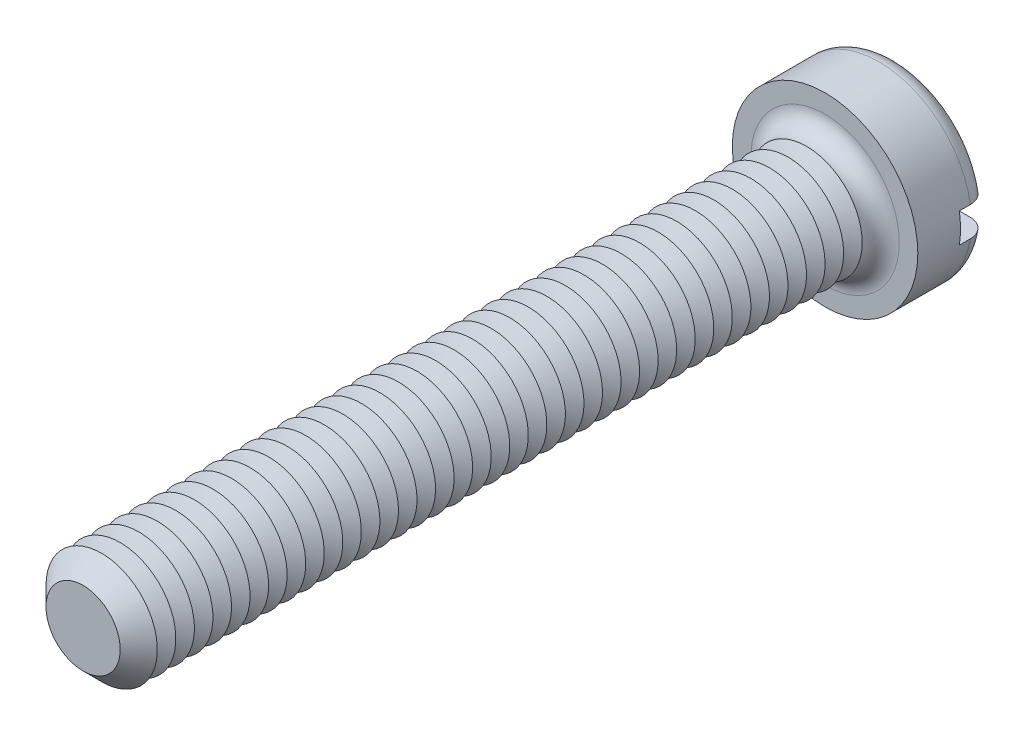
ISO-10303-21;
HEADER;
FILE_DESCRIPTION(('STEP AP214'),'2;1');
FILE_NAME('part.step','',(''),(''),'','','');
FILE_SCHEMA(('AUTOMOTIVE_DESIGN { 1 0 10303 214 1 1 1 1 }'));
ENDSEC;
DATA;
#1=APPLICATION_CONTEXT('core data for automotive mechanical design processes');
#2=APPLICATION_PROTOCOL_DEFINITION('international standard','automotive_design',2000,#1);
#3=PRODUCT_CONTEXT('',#1,'mechanical');
#4=PRODUCT('Part','Part','',(#3));
#5=PRODUCT_RELATED_PRODUCT_CATEGORY('part','',(#4));
#6=PRODUCT_DEFINITION_FORMATION('','',#4);
#7=PRODUCT_DEFINITION_CONTEXT('part definition',#1,'design');
#8=PRODUCT_DEFINITION('design','',#6,#7);
#9=PRODUCT_DEFINITION_SHAPE('','',#8);
#10=(LENGTH_UNIT() NAMED_UNIT(*) SI_UNIT(.MILLI.,.METRE.));
#11=(NAMED_UNIT(*) PLANE_ANGLE_UNIT() SI_UNIT($,.RADIAN.));
#12=(NAMED_UNIT(*) SI_UNIT($,.STERADIAN.) SOLID_ANGLE_UNIT());
#13=UNCERTAINTY_MEASURE_WITH_UNIT(LENGTH_MEASURE(1.E-05),#10,'distance_accuracy_value','');
#14=(GEOMETRIC_REPRESENTATION_CONTEXT(3) GLOBAL_UNCERTAINTY_ASSIGNED_CONTEXT((#13)) GLOBAL_UNIT_ASSIGNED_CONTEXT((#10,
#11,#12)) REPRESENTATION_CONTEXT('',''));
#15=CARTESIAN_POINT('',(0.,0.,0.));
#16=DIRECTION('',(0.,0.,1.));
#17=DIRECTION('',(1.,0.,0.));
#18=AXIS2_PLACEMENT_3D('',#15,#16,#17);
#19=CARTESIAN_POINT('',(0.,0.,-3.9));
#20=DIRECTION('',(0.,0.,1.));
#21=DIRECTION('',(1.,0.,0.));
#22=AXIS2_PLACEMENT_3D('',#19,#20,#21);
#23=PLANE('',#22);
#24=CARTESIAN_POINT('',(0.,0.,-3.9));
#25=DIRECTION('',(0.,0.,1.));
#26=DIRECTION('',(1.,0.,0.));
#27=AXIS2_PLACEMENT_3D('',#24,#25,#26);
#28=CIRCLE('',#27,4.);
#29=CARTESIAN_POINT('',(-3.91918358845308,0.800000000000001,-3.9));
#30=VERTEX_POINT('',#29);
#31=CARTESIAN_POINT('',(3.91918358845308,0.8,-3.9));
#32=VERTEX_POINT('',#31);
#33=EDGE_CURVE('E116',#30,#32,#28,.F.);
#34=ORIENTED_EDGE('',*,*,#33,.T.);
#35=DIRECTION('',(1.,0.,0.));
#36=VECTOR('',#35,1.);
#37=CARTESIAN_POINT('',(-5.,0.800000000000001,-3.9));
#38=LINE('',#37,#36);
#39=EDGE_CURVE('E111',#30,#32,#38,.T.);
#40=ORIENTED_EDGE('',*,*,#39,.F.);
#41=EDGE_LOOP('',(#34,#40));
#42=FACE_BOUND('',#41,.T.);
#43=ADVANCED_FACE('F39',(#42),#23,.F.);
#44=CARTESIAN_POINT('',(0.,0.,-2.9));
#45=DIRECTION('',(0.,0.,1.));
#46=DIRECTION('',(1.,0.,0.));
#47=AXIS2_PLACEMENT_3D('',#44,#45,#46);
#48=TOROIDAL_SURFACE('',#47,4.,1.);
#49=CARTESIAN_POINT('',(-4.76648512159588,0.800000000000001,-3.45304061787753));
#50=CARTESIAN_POINT('',(-4.73486405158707,0.800000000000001,-3.50001565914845));
#51=CARTESIAN_POINT('',(-4.69920787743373,0.800000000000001,-3.54432871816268));
#52=CARTESIAN_POINT('',(-4.62090302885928,0.800000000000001,-3.62634638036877));
#53=CARTESIAN_POINT('',(-4.57824494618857,0.800000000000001,-3.66404194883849));
#54=CARTESIAN_POINT('',(-4.48726975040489,0.800000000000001,-3.73172278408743));
#55=CARTESIAN_POINT('',(-4.43895902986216,0.800000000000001,-3.76171664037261));
#56=CARTESIAN_POINT('',(-4.33804923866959,0.800000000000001,-3.81326437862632));
#57=CARTESIAN_POINT('',(-4.2854512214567,0.800000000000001,-3.8348203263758));
#58=CARTESIAN_POINT('',(-4.17679895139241,0.800000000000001,-3.86918431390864));
#59=CARTESIAN_POINT('',(-4.12071163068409,0.800000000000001,-3.88188775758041));
#60=CARTESIAN_POINT('',(-4.00720729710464,0.800000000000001,-3.89785932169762));
#61=CARTESIAN_POINT('',(-3.94979011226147,0.800000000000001,-3.9011262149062));
#62=CARTESIAN_POINT('',(-3.83429042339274,0.800000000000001,-3.89816676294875));
#63=CARTESIAN_POINT('',(-3.77621176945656,0.800000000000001,-3.89178937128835));
#64=CARTESIAN_POINT('',(-3.66191938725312,0.800000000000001,-3.8694726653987));
#65=CARTESIAN_POINT('',(-3.60570580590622,0.800000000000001,-3.85353259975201));
#66=CARTESIAN_POINT('',(-3.49618749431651,0.800000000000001,-3.81233202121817));
#67=CARTESIAN_POINT('',(-3.44291561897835,0.800000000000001,-3.78698406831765));
#68=CARTESIAN_POINT('',(-3.34140774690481,0.800000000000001,-3.72766098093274));
#69=CARTESIAN_POINT('',(-3.29317182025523,0.800000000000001,-3.69368572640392));
#70=CARTESIAN_POINT('',(-3.20343355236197,0.800000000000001,-3.6182054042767));
#71=CARTESIAN_POINT('',(-3.16189680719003,0.800000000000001,-3.57674128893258));
#72=CARTESIAN_POINT('',(-3.08658236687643,0.800000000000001,-3.48727547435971));
#73=CARTESIAN_POINT('',(-3.05280364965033,0.800000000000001,-3.43927463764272));
#74=CARTESIAN_POINT('',(-2.99489532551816,0.800000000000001,-3.33932895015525));
#75=CARTESIAN_POINT('',(-2.97055012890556,0.800000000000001,-3.28750911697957));
#76=CARTESIAN_POINT('',(-2.93124252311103,0.800000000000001,-3.18042600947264));
#77=CARTESIAN_POINT('',(-2.91627793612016,0.800000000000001,-3.12516353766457));
#78=CARTESIAN_POINT('',(-2.89663075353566,0.800000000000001,-3.01470560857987));
#79=CARTESIAN_POINT('',(-2.89162828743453,0.800000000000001,-2.95956691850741));
#80=CARTESIAN_POINT('',(-2.89112479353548,0.800000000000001,-2.84924961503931));
#81=CARTESIAN_POINT('',(-2.89562264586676,0.800000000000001,-2.79407100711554));
#82=CARTESIAN_POINT('',(-2.91379565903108,0.800000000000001,-2.6861912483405));
#83=CARTESIAN_POINT('',(-2.92731815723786,0.800000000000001,-2.63346424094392));
#84=CARTESIAN_POINT('',(-2.96290888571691,0.800000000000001,-2.53098203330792));
#85=CARTESIAN_POINT('',(-2.98497757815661,0.800000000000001,-2.48122699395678));
#86=CARTESIAN_POINT('',(-3.03728055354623,0.800000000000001,-2.38535286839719));
#87=CARTESIAN_POINT('',(-3.06761989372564,0.800000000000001,-2.33929117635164));
#88=CARTESIAN_POINT('',(-3.13537950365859,0.800000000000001,-2.2527125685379));
#89=CARTESIAN_POINT('',(-3.17280082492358,0.800000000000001,-2.21219647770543));
#90=CARTESIAN_POINT('',(-3.2549164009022,0.800000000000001,-2.13651195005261));
#91=CARTESIAN_POINT('',(-3.29980186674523,0.800000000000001,-2.10155095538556));
#92=CARTESIAN_POINT('',(-3.39467666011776,0.800000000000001,-2.03942270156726));
#93=CARTESIAN_POINT('',(-3.44466673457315,0.800000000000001,-2.01225658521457));
#94=CARTESIAN_POINT('',(-3.5497933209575,0.800000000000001,-1.96576935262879));
#95=CARTESIAN_POINT('',(-3.60503228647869,0.800000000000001,-1.94667963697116));
#96=CARTESIAN_POINT('',(-3.71791613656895,0.800000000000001,-1.91794308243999));
#97=CARTESIAN_POINT('',(-3.77556119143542,0.800000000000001,-1.90829691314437));
#98=CARTESIAN_POINT('',(-3.89221522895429,0.800000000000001,-1.89869331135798));
#99=CARTESIAN_POINT('',(-3.9512319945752,0.800000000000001,-1.89882985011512));
#100=CARTESIAN_POINT('',(-4.06839541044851,0.800000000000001,-1.90907818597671));
#101=CARTESIAN_POINT('',(-4.12654207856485,0.800000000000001,-1.91918977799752));
#102=CARTESIAN_POINT('',(-4.23988103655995,0.800000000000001,-1.9490667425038));
#103=CARTESIAN_POINT('',(-4.29509069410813,0.800000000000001,-1.96876615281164));
#104=CARTESIAN_POINT('',(-4.40134194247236,0.800000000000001,-2.01729572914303));
#105=CARTESIAN_POINT('',(-4.45238383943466,0.800000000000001,-2.04612522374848));
#106=CARTESIAN_POINT('',(-4.54801343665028,0.800000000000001,-2.1116316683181));
#107=CARTESIAN_POINT('',(-4.59268768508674,0.800000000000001,-2.14818225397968));
#108=CARTESIAN_POINT('',(-4.67513924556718,0.800000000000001,-2.22837632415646));
#109=CARTESIAN_POINT('',(-4.71291715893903,0.800000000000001,-2.27201918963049));
#110=CARTESIAN_POINT('',(-4.77986554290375,0.800000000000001,-2.36439990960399));
#111=CARTESIAN_POINT('',(-4.80916462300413,0.800000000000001,-2.41304457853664));
#112=CARTESIAN_POINT('',(-4.85906149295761,0.800000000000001,-2.51460659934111));
#113=CARTESIAN_POINT('',(-4.8796602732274,0.800000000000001,-2.56752346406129));
#114=CARTESIAN_POINT('',(-4.9113264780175,0.800000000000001,-2.67542592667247));
#115=CARTESIAN_POINT('',(-4.92250819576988,0.800000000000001,-2.73037800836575));
#116=CARTESIAN_POINT('',(-4.93542682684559,0.800000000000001,-2.84139649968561));
#117=CARTESIAN_POINT('',(-4.93716171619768,0.800000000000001,-2.89746314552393));
#118=CARTESIAN_POINT('',(-4.93114851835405,0.800000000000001,-3.00876455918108));
#119=CARTESIAN_POINT('',(-4.92345325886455,0.800000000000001,-3.0640022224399));
#120=CARTESIAN_POINT('',(-4.8989032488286,0.800000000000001,-3.17235240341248));
#121=CARTESIAN_POINT('',(-4.88205998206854,0.800000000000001,-3.22546749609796));
#122=CARTESIAN_POINT('',(-4.84819200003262,0.800000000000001,-3.30764066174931));
#123=CARTESIAN_POINT('',(-4.83390853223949,0.800000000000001,-3.33785845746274));
#124=CARTESIAN_POINT('',(-4.80237957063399,0.800000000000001,-3.39670633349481));
#125=CARTESIAN_POINT('',(-4.78513409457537,0.800000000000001,-3.42533642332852));
#126=CARTESIAN_POINT('',(-4.76648512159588,0.800000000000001,-3.45304061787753));
#127=B_SPLINE_CURVE_WITH_KNOTS('',3,(#49,#50,#51,#52,#53,#54,#55,#56,#57,#58,#59,#60,#61,#62,
#63,#64,#65,#66,#67,#68,#69,#70,#71,#72,#73,#74,#75,#76,#77,#78,#79,#80,#81,#82,#83,#84,#85,#86,
#87,#88,#89,#90,#91,#92,#93,#94,#95,#96,#97,#98,#99,#100,#101,#102,#103,#104,#105,#106,#107,
#108,#109,#110,#111,#112,#113,#114,#115,#116,#117,#118,#119,#120,#121,#122,#123,#124,#125,#126),
.UNSPECIFIED.,.T.,.F.,(4,2,2,2,2,2,2,2,2,2,2,2,2,2,2,2,2,2,2,2,2,2,2,2,2,2,2,2,2,2,2,2,2,2,2,2,
2,2,4),(0.,0.169755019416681,0.339740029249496,0.509534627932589,0.67928763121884,
0.851013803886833,1.02276230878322,1.19722869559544,1.37170879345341,1.54785292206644,
1.72399950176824,1.89921049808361,2.07439839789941,2.24530597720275,2.41617386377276,
2.58146078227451,2.74672821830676,2.90926852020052,3.0718176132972,3.2365363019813,
3.40127946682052,3.57118676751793,3.74111896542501,3.91563534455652,4.09016409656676,
4.26636956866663,4.4425714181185,4.61757781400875,4.79257134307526,4.96489650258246,
5.13720662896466,5.30674670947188,5.47626748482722,5.64369988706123,5.81116816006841,
5.97770254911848,6.14402836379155,6.24414438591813,6.34425980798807),.UNSPECIFIED.);
#128=CARTESIAN_POINT('',(-4.93558507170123,0.800000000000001,-2.9));
#129=VERTEX_POINT('',#128);
#130=EDGE_CURVE('E483',#129,#30,#127,.T.);
#131=ORIENTED_EDGE('',*,*,#130,.F.);
#132=CARTESIAN_POINT('',(0.,0.,-2.9));
#133=DIRECTION('',(0.,0.,1.));
#134=DIRECTION('',(1.,0.,0.));
#135=AXIS2_PLACEMENT_3D('',#132,#133,#134);
#136=CIRCLE('',#135,5.);
#137=CARTESIAN_POINT('',(4.93558507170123,0.8,-2.9));
#138=VERTEX_POINT('',#137);
#139=EDGE_CURVE('E125',#138,#129,#136,.T.);
#140=ORIENTED_EDGE('',*,*,#139,.F.);
#141=CARTESIAN_POINT('',(2.98553785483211,0.8,-3.31649797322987));
#142=CARTESIAN_POINT('',(3.00991125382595,0.8,-3.36788093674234));
#143=CARTESIAN_POINT('',(3.03875556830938,0.8,-3.41719756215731));
#144=CARTESIAN_POINT('',(3.1043993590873,0.8,-3.51028676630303));
#145=CARTESIAN_POINT('',(3.1412115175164,0.8,-3.55405032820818));
#146=CARTESIAN_POINT('',(3.22153641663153,0.8,-3.63476402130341));
#147=CARTESIAN_POINT('',(3.26503706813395,0.8,-3.67172618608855));
#148=CARTESIAN_POINT('',(3.35749627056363,0.8,-3.73799476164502));
#149=CARTESIAN_POINT('',(3.4064533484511,0.8,-3.76730323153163));
#150=CARTESIAN_POINT('',(3.5095773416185,0.8,-3.81809642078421));
#151=CARTESIAN_POINT('',(3.56383317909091,0.8,-3.83940072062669));
#152=CARTESIAN_POINT('',(3.67513017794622,0.8,-3.87272481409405));
#153=CARTESIAN_POINT('',(3.7321717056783,0.8,-3.88474338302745));
#154=CARTESIAN_POINT('',(3.84815688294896,0.8,-3.89923413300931));
#155=CARTESIAN_POINT('',(3.90711516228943,0.8,-3.9015896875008));
#156=CARTESIAN_POINT('',(4.02458610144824,0.8,-3.89631753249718));
#157=CARTESIAN_POINT('',(4.08309876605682,0.8,-3.8886899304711));
#158=CARTESIAN_POINT('',(4.19768646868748,0.8,-3.86366584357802));
#159=CARTESIAN_POINT('',(4.25377243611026,0.8,-3.84631948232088));
#160=CARTESIAN_POINT('',(4.3621676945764,0.8,-3.80231797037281));
#161=CARTESIAN_POINT('',(4.41447726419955,0.8,-3.77566350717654));
#162=CARTESIAN_POINT('',(4.51300872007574,0.8,-3.71421163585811));
#163=CARTESIAN_POINT('',(4.5593085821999,0.8,-3.67953927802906));
#164=CARTESIAN_POINT('',(4.64530675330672,0.8,-3.60279495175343));
#165=CARTESIAN_POINT('',(4.68500564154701,0.8,-3.56072363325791));
#166=CARTESIAN_POINT('',(4.75599202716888,0.8,-3.47111750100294));
#167=CARTESIAN_POINT('',(4.7874061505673,0.8,-3.42368298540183));
#168=CARTESIAN_POINT('',(4.84170328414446,0.8,-3.32415927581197));
#169=CARTESIAN_POINT('',(4.86458695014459,0.8,-3.2720704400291));
#170=CARTESIAN_POINT('',(4.90088120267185,0.8,-3.16544016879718));
#171=CARTESIAN_POINT('',(4.91440984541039,0.8,-3.11093889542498));
#172=CARTESIAN_POINT('',(4.93205429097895,0.8,-3.00043391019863));
#173=CARTESIAN_POINT('',(4.93617053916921,0.8,-2.9444302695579));
#174=CARTESIAN_POINT('',(4.93486973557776,0.8,-2.83292218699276));
#175=CARTESIAN_POINT('',(4.92951827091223,0.8,-2.77741696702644));
#176=CARTESIAN_POINT('',(4.90957104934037,0.8,-2.66809456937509));
#177=CARTESIAN_POINT('',(4.89497541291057,0.8,-2.61427736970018));
#178=CARTESIAN_POINT('',(4.85697876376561,0.8,-2.50985095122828));
#179=CARTESIAN_POINT('',(4.83357805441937,0.8,-2.45924162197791));
#180=CARTESIAN_POINT('',(4.77866660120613,0.8,-2.36263484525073));
#181=CARTESIAN_POINT('',(4.74715567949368,0.8,-2.31663749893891));
#182=CARTESIAN_POINT('',(4.67670791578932,0.8,-2.23021464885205));
#183=CARTESIAN_POINT('',(4.6377224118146,0.8,-2.1898288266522));
#184=CARTESIAN_POINT('',(4.55359880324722,0.8,-2.11607828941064));
#185=CARTESIAN_POINT('',(4.50846036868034,0.8,-2.08271395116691));
#186=CARTESIAN_POINT('',(4.41271544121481,0.8,-2.02349513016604));
#187=CARTESIAN_POINT('',(4.36204749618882,0.8,-1.99774003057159));
#188=CARTESIAN_POINT('',(4.257155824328,0.8,-1.95495040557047));
#189=CARTESIAN_POINT('',(4.20293181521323,0.8,-1.93791657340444));
#190=CARTESIAN_POINT('',(4.09154156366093,0.8,-1.91276335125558));
#191=CARTESIAN_POINT('',(4.03434212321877,0.8,-1.90479098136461));
#192=CARTESIAN_POINT('',(3.91941228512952,0.8,-1.89840884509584));
#193=CARTESIAN_POINT('',(3.8616818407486,0.8,-1.89999992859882));
#194=CARTESIAN_POINT('',(3.7464111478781,0.8,-1.91275144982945));
#195=CARTESIAN_POINT('',(3.6888866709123,0.8,-1.92405471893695));
#196=CARTESIAN_POINT('',(3.57652290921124,0.8,-1.95609086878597));
#197=CARTESIAN_POINT('',(3.52168382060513,0.8,-1.97682443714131));
#198=CARTESIAN_POINT('',(3.41589179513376,0.8,-2.02733294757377));
#199=CARTESIAN_POINT('',(3.36496676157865,0.8,-2.05716640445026));
#200=CARTESIAN_POINT('',(3.26890903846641,0.8,-2.12504079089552));
#201=CARTESIAN_POINT('',(3.22377627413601,0.8,-2.16308161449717));
#202=CARTESIAN_POINT('',(3.141135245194,0.8,-2.24593284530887));
#203=CARTESIAN_POINT('',(3.1035541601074,0.8,-2.29067053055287));
#204=CARTESIAN_POINT('',(3.03669700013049,0.8,-2.38597317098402));
#205=CARTESIAN_POINT('',(3.00741914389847,0.8,-2.43653687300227));
#206=CARTESIAN_POINT('',(2.95891799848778,0.8,-2.54052959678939));
#207=CARTESIAN_POINT('',(2.93943249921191,0.8,-2.59383627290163));
#208=CARTESIAN_POINT('',(2.9100081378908,0.8,-2.70303736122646));
#209=CARTESIAN_POINT('',(2.90006970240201,0.8,-2.75893188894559));
#210=CARTESIAN_POINT('',(2.89027863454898,0.8,-2.86986958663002));
#211=CARTESIAN_POINT('',(2.89012791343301,0.8,-2.92488680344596));
#212=CARTESIAN_POINT('',(2.89917145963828,0.8,-3.03409648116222));
#213=CARTESIAN_POINT('',(2.90835313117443,0.8,-3.08828995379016));
#214=CARTESIAN_POINT('',(2.92977618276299,0.8,-3.17141652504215));
#215=CARTESIAN_POINT('',(2.93899011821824,0.8,-3.20116372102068));
#216=CARTESIAN_POINT('',(2.96020249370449,0.8,-3.25964614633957));
#217=CARTESIAN_POINT('',(2.97220082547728,0.8,-3.28838141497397));
#218=CARTESIAN_POINT('',(2.98553785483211,0.8,-3.31649797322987));
#219=B_SPLINE_CURVE_WITH_KNOTS('',3,(#141,#142,#143,#144,#145,#146,#147,#148,#149,#150,#151,
#152,#153,#154,#155,#156,#157,#158,#159,#160,#161,#162,#163,#164,#165,#166,#167,#168,#169,#170,
#171,#172,#173,#174,#175,#176,#177,#178,#179,#180,#181,#182,#183,#184,#185,#186,#187,#188,#189,
#190,#191,#192,#193,#194,#195,#196,#197,#198,#199,#200,#201,#202,#203,#204,#205,#206,#207,#208,
#209,#210,#211,#212,#213,#214,#215,#216,#217,#218),.UNSPECIFIED.,.T.,.F.,(4,2,2,2,2,2,2,2,2,2,2,
2,2,2,2,2,2,2,2,2,2,2,2,2,2,2,2,2,2,2,2,2,2,2,2,2,2,2,4),(0.,0.170493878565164,
0.341261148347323,0.511723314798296,0.682139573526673,0.856194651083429,1.03027268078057,
1.20644565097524,1.38261672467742,1.55788746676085,1.73314526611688,1.90583484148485,
2.07850925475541,2.24836742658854,2.41821253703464,2.58587311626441,2.75352576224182,
2.92002154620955,3.08651516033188,3.25300303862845,3.41949456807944,3.58710926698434,
3.75473295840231,3.92445790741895,4.09419634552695,4.26665110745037,4.43912119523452,
4.61417197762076,4.78923552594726,4.96544940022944,5.1416609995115,5.31608191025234,
5.49046537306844,5.65989063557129,5.82932346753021,5.99359365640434,6.157642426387,
6.250939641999,6.34423323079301),.UNSPECIFIED.);
#220=EDGE_CURVE('E485',#32,#138,#219,.T.);
#221=ORIENTED_EDGE('',*,*,#220,.F.);
#222=ORIENTED_EDGE('',*,*,#33,.F.);
#223=EDGE_LOOP('',(#131,#140,#221,#222));
#224=FACE_BOUND('',#223,.T.);
#225=ADVANCED_FACE('F467',(#224),#48,.T.);
#226=CARTESIAN_POINT('',(0.,0.,-3.9));
#227=DIRECTION('',(0.,0.,1.));
#228=DIRECTION('',(1.,0.,0.));
#229=AXIS2_PLACEMENT_3D('',#226,#227,#228);
#230=CYLINDRICAL_SURFACE('',#229,5.);
#231=DIRECTION('',(0.,0.,1.));
#232=VECTOR('',#231,1.);
#233=CARTESIAN_POINT('',(4.93558507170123,0.8,-3.9));
#234=LINE('',#233,#232);
#235=CARTESIAN_POINT('',(4.93558507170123,0.8,-2.3));
#236=VERTEX_POINT('',#235);
#237=EDGE_CURVE('E499',#138,#236,#234,.T.);
#238=ORIENTED_EDGE('',*,*,#237,.F.);
#239=ORIENTED_EDGE('',*,*,#139,.T.);
#240=DIRECTION('',(0.,0.,1.));
#241=VECTOR('',#240,1.);
#242=CARTESIAN_POINT('',(-4.93558507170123,0.800000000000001,-3.9));
#243=LINE('',#242,#241);
#244=CARTESIAN_POINT('',(-4.93558507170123,0.800000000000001,-2.3));
#245=VERTEX_POINT('',#244);
#246=EDGE_CURVE('E63',#245,#129,#243,.F.);
#247=ORIENTED_EDGE('',*,*,#246,.F.);
#248=CARTESIAN_POINT('',(0.,0.,-2.3));
#249=DIRECTION('',(0.,0.,-1.));
#250=DIRECTION('',(-1.,0.,0.));
#251=AXIS2_PLACEMENT_3D('',#248,#249,#250);
#252=CIRCLE('',#251,5.);
#253=CARTESIAN_POINT('',(-4.93558507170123,-0.799999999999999,-2.3));
#254=VERTEX_POINT('',#253);
#255=EDGE_CURVE('E43',#245,#254,#252,.F.);
#256=ORIENTED_EDGE('',*,*,#255,.T.);
#257=DIRECTION('',(0.,0.,1.));
#258=VECTOR('',#257,1.);
#259=CARTESIAN_POINT('',(-4.93558507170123,-0.799999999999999,-3.9));
#260=LINE('',#259,#258);
#261=CARTESIAN_POINT('',(-4.93558507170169,-0.799999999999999,-2.89999999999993));
#262=VERTEX_POINT('',#261);
#263=EDGE_CURVE('E497',#262,#254,#260,.T.);
#264=ORIENTED_EDGE('',*,*,#263,.F.);
#265=CARTESIAN_POINT('',(4.93558507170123,-0.8,-2.9));
#266=VERTEX_POINT('',#265);
#267=EDGE_CURVE('E127',#262,#266,#136,.T.);
#268=ORIENTED_EDGE('',*,*,#267,.T.);
#269=DIRECTION('',(0.,0.,1.));
#270=VECTOR('',#269,1.);
#271=CARTESIAN_POINT('',(4.93558507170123,-0.8,-3.9));
#272=LINE('',#271,#270);
#273=CARTESIAN_POINT('',(4.93558507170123,-0.8,-2.3));
#274=VERTEX_POINT('',#273);
#275=EDGE_CURVE('E55',#274,#266,#272,.F.);
#276=ORIENTED_EDGE('',*,*,#275,.F.);
#277=EDGE_CURVE('E11',#274,#236,#252,.F.);
#278=ORIENTED_EDGE('',*,*,#277,.T.);
#279=EDGE_LOOP('',(#238,#239,#247,#256,#264,#268,#276,#278));
#280=FACE_BOUND('',#279,.T.);
#281=CARTESIAN_POINT('',(0.,0.,0.));
#282=DIRECTION('',(0.,0.,1.));
#283=DIRECTION('',(1.,0.,0.));
#284=AXIS2_PLACEMENT_3D('',#281,#282,#283);
#285=CIRCLE('',#284,5.);
#286=CARTESIAN_POINT('',(5.,0.,0.));
#287=VERTEX_POINT('',#286);
#288=EDGE_CURVE('E502',#287,#287,#285,.T.);
#289=ORIENTED_EDGE('',*,*,#288,.F.);
#290=EDGE_LOOP('',(#289));
#291=FACE_BOUND('',#290,.T.);
#292=ADVANCED_FACE('F463',(#280,#291),#230,.T.);
#293=CARTESIAN_POINT('',(3.91918358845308,-0.8,-3.9));
#294=VERTEX_POINT('',#293);
#295=CARTESIAN_POINT('',(-3.91918358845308,-0.799999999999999,-3.9));
#296=VERTEX_POINT('',#295);
#297=EDGE_CURVE('E109',#294,#296,#28,.F.);
#298=ORIENTED_EDGE('',*,*,#297,.T.);
#299=DIRECTION('',(-1.,0.,0.));
#300=VECTOR('',#299,1.);
#301=CARTESIAN_POINT('',(-5.,-0.799999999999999,-3.9));
#302=LINE('',#301,#300);
#303=EDGE_CURVE('E96',#294,#296,#302,.T.);
#304=ORIENTED_EDGE('',*,*,#303,.F.);
#305=EDGE_LOOP('',(#298,#304));
#306=FACE_BOUND('',#305,.T.);
#307=ADVANCED_FACE('F108',(#306),#23,.F.);
#308=CARTESIAN_POINT('',(0.,0.,0.));
#309=DIRECTION('',(0.,0.,1.));
#310=DIRECTION('',(1.,0.,0.));
#311=AXIS2_PLACEMENT_3D('',#308,#309,#310);
#312=PLANE('',#311);
#313=CARTESIAN_POINT('',(0.,0.,0.));
#314=DIRECTION('',(0.,0.,1.));
#315=DIRECTION('',(1.,0.,0.));
#316=AXIS2_PLACEMENT_3D('',#313,#314,#315);
#317=CIRCLE('',#316,4.);
#318=CARTESIAN_POINT('',(4.,0.,0.));
#319=VERTEX_POINT('',#318);
#320=EDGE_CURVE('E115',#319,#319,#317,.F.);
#321=ORIENTED_EDGE('',*,*,#320,.T.);
#322=EDGE_LOOP('',(#321));
#323=FACE_BOUND('',#322,.T.);
#324=ORIENTED_EDGE('',*,*,#288,.T.);
#325=EDGE_LOOP('',(#324));
#326=FACE_BOUND('',#325,.T.);
#327=ADVANCED_FACE('F462',(#323,#326),#312,.T.);
#328=CARTESIAN_POINT('',(-4.76648512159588,-0.799999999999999,-3.45304061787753));
#329=CARTESIAN_POINT('',(-4.7975694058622,-0.799999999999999,-3.40685392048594));
#330=CARTESIAN_POINT('',(-4.82479903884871,-0.799999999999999,-3.35802740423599));
#331=CARTESIAN_POINT('',(-4.87070632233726,-0.799999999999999,-3.25646127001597));
#332=CARTESIAN_POINT('',(-4.8893747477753,-0.799999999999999,-3.20371750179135));
#333=CARTESIAN_POINT('',(-4.91756720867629,-0.799999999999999,-3.09584501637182));
#334=CARTESIAN_POINT('',(-4.92709302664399,-0.799999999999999,-3.04071676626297));
#335=CARTESIAN_POINT('',(-4.93671217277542,-0.799999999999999,-2.92965669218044));
#336=CARTESIAN_POINT('',(-4.93680767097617,-0.799999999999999,-2.87372505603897));
#337=CARTESIAN_POINT('',(-4.92758675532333,-0.799999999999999,-2.76284675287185));
#338=CARTESIAN_POINT('',(-4.91830421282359,-0.799999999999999,-2.70789726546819));
#339=CARTESIAN_POINT('',(-4.89065741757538,-0.799999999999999,-2.60033228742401));
#340=CARTESIAN_POINT('',(-4.87229291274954,-0.799999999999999,-2.54771686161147));
#341=CARTESIAN_POINT('',(-4.82699855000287,-0.799999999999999,-2.44622441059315));
#342=CARTESIAN_POINT('',(-4.80005659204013,-0.799999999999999,-2.39735278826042));
#343=CARTESIAN_POINT('',(-4.73841244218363,-0.799999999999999,-2.30477947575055));
#344=CARTESIAN_POINT('',(-4.70371003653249,-0.799999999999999,-2.26107792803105));
#345=CARTESIAN_POINT('',(-4.62724516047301,-0.799999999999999,-2.17969334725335));
#346=CARTESIAN_POINT('',(-4.58542787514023,-0.799999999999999,-2.14206183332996));
#347=CARTESIAN_POINT('',(-4.49614171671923,-0.799999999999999,-2.07424284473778));
#348=CARTESIAN_POINT('',(-4.44867251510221,-0.799999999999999,-2.04405580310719));
#349=CARTESIAN_POINT('',(-4.34875035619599,-0.799999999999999,-1.99153688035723));
#350=CARTESIAN_POINT('',(-4.29623870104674,-0.799999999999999,-1.96931670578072));
#351=CARTESIAN_POINT('',(-4.18826905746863,-0.799999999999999,-1.93384994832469));
#352=CARTESIAN_POINT('',(-4.1328108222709,-0.799999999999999,-1.92060411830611));
#353=CARTESIAN_POINT('',(-4.01956054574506,-0.799999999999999,-1.90323798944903));
#354=CARTESIAN_POINT('',(-3.96174522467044,-0.799999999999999,-1.89926947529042));
#355=CARTESIAN_POINT('',(-3.84625419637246,-0.799999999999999,-1.90095183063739));
#356=CARTESIAN_POINT('',(-3.78857850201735,-0.799999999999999,-1.90660355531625));
#357=CARTESIAN_POINT('',(-3.67415602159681,-0.799999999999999,-1.92748272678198));
#358=CARTESIAN_POINT('',(-3.61743328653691,-0.799999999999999,-1.94284216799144));
#359=CARTESIAN_POINT('',(-3.50734962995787,-0.799999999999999,-1.9828275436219));
#360=CARTESIAN_POINT('',(-3.4539889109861,-0.799999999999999,-2.00745403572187));
#361=CARTESIAN_POINT('',(-3.35197118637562,-0.799999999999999,-2.06542964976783));
#362=CARTESIAN_POINT('',(-3.30333217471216,-0.799999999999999,-2.0988104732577));
#363=CARTESIAN_POINT('',(-3.21244692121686,-0.799999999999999,-2.17337326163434));
#364=CARTESIAN_POINT('',(-3.17020039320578,-0.799999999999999,-2.21455487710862));
#365=CARTESIAN_POINT('',(-3.0940098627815,-0.799999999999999,-2.30296695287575));
#366=CARTESIAN_POINT('',(-3.05995540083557,-0.799999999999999,-2.35010211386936));
#367=CARTESIAN_POINT('',(-3.00053815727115,-0.799999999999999,-2.4495670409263));
#368=CARTESIAN_POINT('',(-2.97517362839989,-0.799999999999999,-2.50189576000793));
#369=CARTESIAN_POINT('',(-2.93470320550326,-0.799999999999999,-2.60853979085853));
#370=CARTESIAN_POINT('',(-2.91930557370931,-0.799999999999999,-2.66274437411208));
#371=CARTESIAN_POINT('',(-2.89812734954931,-0.799999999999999,-2.77299836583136));
#372=CARTESIAN_POINT('',(-2.89234481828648,-0.799999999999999,-2.82904740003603));
#373=CARTESIAN_POINT('',(-2.89064073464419,-0.799999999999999,-2.93970612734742));
#374=CARTESIAN_POINT('',(-2.89444549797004,-0.799999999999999,-2.99431180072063));
#375=CARTESIAN_POINT('',(-2.9112006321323,-0.799999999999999,-3.10209766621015));
#376=CARTESIAN_POINT('',(-2.9241507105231,-0.799999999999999,-3.1552779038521));
#377=CARTESIAN_POINT('',(-2.95868580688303,-0.799999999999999,-3.25858631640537));
#378=CARTESIAN_POINT('',(-2.98024709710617,-0.799999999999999,-3.30872244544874));
#379=CARTESIAN_POINT('',(-3.03128544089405,-0.799999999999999,-3.40478519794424));
#380=CARTESIAN_POINT('',(-3.06076335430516,-0.799999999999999,-3.45071136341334));
#381=CARTESIAN_POINT('',(-3.12753448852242,-0.799999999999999,-3.53826932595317));
#382=CARTESIAN_POINT('',(-3.16500083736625,-0.799999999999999,-3.57976901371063));
#383=CARTESIAN_POINT('',(-3.24617503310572,-0.799999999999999,-3.65613204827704));
#384=CARTESIAN_POINT('',(-3.28988388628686,-0.799999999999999,-3.69099432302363));
#385=CARTESIAN_POINT('',(-3.38380639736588,-0.799999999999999,-3.75424083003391));
#386=CARTESIAN_POINT('',(-3.43418287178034,-0.799999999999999,-3.78238342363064));
#387=CARTESIAN_POINT('',(-3.53887888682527,-0.799999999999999,-3.83000231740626));
#388=CARTESIAN_POINT('',(-3.59319889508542,-0.799999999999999,-3.84947758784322));
#389=CARTESIAN_POINT('',(-3.70539237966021,-0.799999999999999,-3.87954336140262));
#390=CARTESIAN_POINT('',(-3.76331464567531,-0.799999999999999,-3.88995217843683));
#391=CARTESIAN_POINT('',(-3.88008461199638,-0.799999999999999,-3.9009132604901));
#392=CARTESIAN_POINT('',(-3.93893230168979,-0.799999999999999,-3.9014656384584));
#393=CARTESIAN_POINT('',(-4.05594892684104,-0.799999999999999,-3.89264187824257));
#394=CARTESIAN_POINT('',(-4.11411702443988,-0.799999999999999,-3.88325457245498));
#395=CARTESIAN_POINT('',(-4.22802928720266,-0.799999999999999,-3.85472582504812));
#396=CARTESIAN_POINT('',(-4.28377297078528,-0.799999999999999,-3.83558245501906));
#397=CARTESIAN_POINT('',(-4.39054463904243,-0.799999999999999,-3.78829842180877));
#398=CARTESIAN_POINT('',(-4.44161887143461,-0.799999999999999,-3.76026208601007));
#399=CARTESIAN_POINT('',(-4.53818016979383,-0.799999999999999,-3.69589278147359));
#400=CARTESIAN_POINT('',(-4.58367442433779,-0.799999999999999,-3.65957066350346));
#401=CARTESIAN_POINT('',(-4.65208830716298,-0.799999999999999,-3.59453310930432));
#402=CARTESIAN_POINT('',(-4.67711825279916,-0.799999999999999,-3.56800018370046));
#403=CARTESIAN_POINT('',(-4.72414423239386,-0.799999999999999,-3.51236863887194));
#404=CARTESIAN_POINT('',(-4.74614029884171,-0.799999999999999,-3.48327004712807));
#405=CARTESIAN_POINT('',(-4.76648512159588,-0.799999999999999,-3.45304061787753));
#406=B_SPLINE_CURVE_WITH_KNOTS('',3,(#328,#329,#330,#331,#332,#333,#334,#335,#336,#337,#338,
#339,#340,#341,#342,#343,#344,#345,#346,#347,#348,#349,#350,#351,#352,#353,#354,#355,#356,#357,
#358,#359,#360,#361,#362,#363,#364,#365,#366,#367,#368,#369,#370,#371,#372,#373,#374,#375,#376,
#377,#378,#379,#380,#381,#382,#383,#384,#385,#386,#387,#388,#389,#390,#391,#392,#393,#394,#395,
#396,#397,#398,#399,#400,#401,#402,#403,#404,#405),.UNSPECIFIED.,.T.,.F.,(4,2,2,2,2,2,2,2,2,2,2,
2,2,2,2,2,2,2,2,2,2,2,2,2,2,2,2,2,2,2,2,2,2,2,2,2,2,2,4),(0.,0.166886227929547,
0.333951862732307,0.500984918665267,0.667979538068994,0.834373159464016,1.00077139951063,
1.16740542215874,1.33404403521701,1.50202999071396,1.67002571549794,1.84029248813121,
2.01057354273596,2.18362161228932,2.35668506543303,2.53215380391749,2.70763310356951,
2.88375684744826,3.05987270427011,3.23346085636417,3.40701408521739,3.57522519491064,
3.74340238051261,3.90683338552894,4.0702591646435,4.23323770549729,4.39623395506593,
4.56320691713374,4.7302068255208,4.90252468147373,5.07486300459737,5.25058028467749,
5.42629555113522,5.60220844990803,5.77815613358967,5.95211162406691,6.12584060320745,
6.23506966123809,6.34429754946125),.UNSPECIFIED.);
#407=EDGE_CURVE('E103',#296,#262,#406,.T.);
#408=ORIENTED_EDGE('',*,*,#407,.F.);
#409=ORIENTED_EDGE('',*,*,#297,.F.);
#410=CARTESIAN_POINT('',(2.98553785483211,-0.8,-3.31649797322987));
#411=CARTESIAN_POINT('',(2.96216773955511,-0.8,-3.26721849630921));
#412=CARTESIAN_POINT('',(2.94287503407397,-0.8,-3.21596872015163));
#413=CARTESIAN_POINT('',(2.91313258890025,-0.8,-3.11092723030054));
#414=CARTESIAN_POINT('',(2.9026902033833,-0.8,-3.0571334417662));
#415=CARTESIAN_POINT('',(2.89104377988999,-0.8,-2.94853922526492));
#416=CARTESIAN_POINT('',(2.88984130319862,-0.8,-2.89373862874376));
#417=CARTESIAN_POINT('',(2.89672585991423,-0.8,-2.78473646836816));
#418=CARTESIAN_POINT('',(2.90481120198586,-0.8,-2.73053479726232));
#419=CARTESIAN_POINT('',(2.92989134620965,-0.8,-2.62460092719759));
#420=CARTESIAN_POINT('',(2.94682969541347,-0.8,-2.57285532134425));
#421=CARTESIAN_POINT('',(2.9889990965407,-0.8,-2.47286425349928));
#422=CARTESIAN_POINT('',(3.01423103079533,-0.8,-2.42461916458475));
#423=CARTESIAN_POINT('',(3.07271536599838,-0.8,-2.33201565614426));
#424=CARTESIAN_POINT('',(3.10610710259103,-0.8,-2.28774532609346));
#425=CARTESIAN_POINT('',(3.17963417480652,-0.8,-2.205215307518));
#426=CARTESIAN_POINT('',(3.21977054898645,-0.8,-2.16695654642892));
#427=CARTESIAN_POINT('',(3.3070361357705,-0.8,-2.09624274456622));
#428=CARTESIAN_POINT('',(3.35434874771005,-0.8,-2.06401396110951));
#429=CARTESIAN_POINT('',(3.45361131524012,-0.8,-2.00773436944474));
#430=CARTESIAN_POINT('',(3.50556189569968,-0.8,-1.98368466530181));
#431=CARTESIAN_POINT('',(3.61398433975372,-0.8,-1.94389460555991));
#432=CARTESIAN_POINT('',(3.67053506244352,-0.8,-1.92836880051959));
#433=CARTESIAN_POINT('',(3.78543606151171,-0.8,-1.90696594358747));
#434=CARTESIAN_POINT('',(3.84378643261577,-0.8,-1.90108940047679));
#435=CARTESIAN_POINT('',(3.96100201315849,-0.8,-1.89918115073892));
#436=CARTESIAN_POINT('',(4.01986821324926,-0.8,-1.90320860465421));
#437=CARTESIAN_POINT('',(4.13606891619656,-0.8,-1.9211820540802));
#438=CARTESIAN_POINT('',(4.19340347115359,-0.8,-1.93512771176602));
#439=CARTESIAN_POINT('',(4.30434213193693,-0.8,-1.97243705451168));
#440=CARTESIAN_POINT('',(4.35797549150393,-0.8,-1.99571368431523));
#441=CARTESIAN_POINT('',(4.46048254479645,-0.8,-2.0510826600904));
#442=CARTESIAN_POINT('',(4.50935662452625,-0.8,-2.08317429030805));
#443=CARTESIAN_POINT('',(4.60012348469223,-0.8,-2.15471647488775));
#444=CARTESIAN_POINT('',(4.64211506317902,-0.8,-2.19404167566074));
#445=CARTESIAN_POINT('',(4.71877054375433,-0.8,-2.27928299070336));
#446=CARTESIAN_POINT('',(4.75343508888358,-0.8,-2.32519852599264));
#447=CARTESIAN_POINT('',(4.81388799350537,-0.8,-2.4215411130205));
#448=CARTESIAN_POINT('',(4.83980652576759,-0.8,-2.47188650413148));
#449=CARTESIAN_POINT('',(4.88271402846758,-0.8,-2.57624865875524));
#450=CARTESIAN_POINT('',(4.89970360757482,-0.8,-2.63026517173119));
#451=CARTESIAN_POINT('',(4.92409334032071,-0.8,-2.73978844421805));
#452=CARTESIAN_POINT('',(4.93159814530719,-0.8,-2.79527191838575));
#453=CARTESIAN_POINT('',(4.93713723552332,-0.8,-2.90670881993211));
#454=CARTESIAN_POINT('',(4.9351718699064,-0.8,-2.9626622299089));
#455=CARTESIAN_POINT('',(4.92186293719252,-0.8,-3.07317093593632));
#456=CARTESIAN_POINT('',(4.91056393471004,-0.8,-3.12773160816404));
#457=CARTESIAN_POINT('',(4.87898532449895,-0.8,-3.234187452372));
#458=CARTESIAN_POINT('',(4.85870572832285,-0.8,-3.28608262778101));
#459=CARTESIAN_POINT('',(4.80971634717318,-0.8,-3.38586723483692));
#460=CARTESIAN_POINT('',(4.78098824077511,-0.8,-3.43374766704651));
#461=CARTESIAN_POINT('',(4.71596686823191,-0.8,-3.52405937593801));
#462=CARTESIAN_POINT('',(4.67967336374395,-0.8,-3.56649048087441));
#463=CARTESIAN_POINT('',(4.60022577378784,-0.8,-3.64511036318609));
#464=CARTESIAN_POINT('',(4.5570143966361,-0.8,-3.6812412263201));
#465=CARTESIAN_POINT('',(4.4652099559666,-0.8,-3.7458530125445));
#466=CARTESIAN_POINT('',(4.41661654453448,-0.8,-3.77433344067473));
#467=CARTESIAN_POINT('',(4.31470683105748,-0.8,-3.82326981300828));
#468=CARTESIAN_POINT('',(4.26133399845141,-0.8,-3.84360800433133));
#469=CARTESIAN_POINT('',(4.15196444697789,-0.8,-3.87519515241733));
#470=CARTESIAN_POINT('',(4.09596750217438,-0.8,-3.88644332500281));
#471=CARTESIAN_POINT('',(3.98196469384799,-0.8,-3.89971870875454));
#472=CARTESIAN_POINT('',(3.92394096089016,-0.8,-3.901592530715));
#473=CARTESIAN_POINT('',(3.8083852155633,-0.8,-3.89570840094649));
#474=CARTESIAN_POINT('',(3.75085322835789,-0.8,-3.88794995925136));
#475=CARTESIAN_POINT('',(3.6371167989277,-0.8,-3.86287824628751));
#476=CARTESIAN_POINT('',(3.58093962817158,-0.8,-3.84544111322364));
#477=CARTESIAN_POINT('',(3.47227948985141,-0.8,-3.80139971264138));
#478=CARTESIAN_POINT('',(3.41979762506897,-0.8,-3.77479272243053));
#479=CARTESIAN_POINT('',(3.31994061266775,-0.8,-3.71304199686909));
#480=CARTESIAN_POINT('',(3.27257854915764,-0.8,-3.67787710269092));
#481=CARTESIAN_POINT('',(3.18459619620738,-0.8,-3.59999704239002));
#482=CARTESIAN_POINT('',(3.14396747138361,-0.8,-3.55729146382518));
#483=CARTESIAN_POINT('',(3.08341110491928,-0.8,-3.48140072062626));
#484=CARTESIAN_POINT('',(3.06118126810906,-0.8,-3.45002448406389));
#485=CARTESIAN_POINT('',(3.02047302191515,-0.8,-3.38492378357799));
#486=CARTESIAN_POINT('',(3.00199451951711,-0.8,-3.35119937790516));
#487=CARTESIAN_POINT('',(2.98553785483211,-0.8,-3.31649797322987));
#488=B_SPLINE_CURVE_WITH_KNOTS('',3,(#410,#411,#412,#413,#414,#415,#416,#417,#418,#419,#420,
#421,#422,#423,#424,#425,#426,#427,#428,#429,#430,#431,#432,#433,#434,#435,#436,#437,#438,#439,
#440,#441,#442,#443,#444,#445,#446,#447,#448,#449,#450,#451,#452,#453,#454,#455,#456,#457,#458,
#459,#460,#461,#462,#463,#464,#465,#466,#467,#468,#469,#470,#471,#472,#473,#474,#475,#476,#477,
#478,#479,#480,#481,#482,#483,#484,#485,#486,#487),.UNSPECIFIED.,.T.,.F.,(4,2,2,2,2,2,2,2,2,2,2,
2,2,2,2,2,2,2,2,2,2,2,2,2,2,2,2,2,2,2,2,2,2,2,2,2,2,2,4),(0.,0.163484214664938,
0.327104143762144,0.490751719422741,0.654369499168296,0.816956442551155,0.979560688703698,
1.14516376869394,1.31079237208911,1.48174839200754,1.6527274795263,1.82783306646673,
2.00294788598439,2.17911127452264,2.35526866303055,2.52981944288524,2.70435605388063,
2.87611266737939,3.04785420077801,3.21691347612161,3.38596122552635,3.55312700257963,
3.72028661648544,3.88665268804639,4.053018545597,4.2197478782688,4.38648246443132,
4.55467705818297,4.72288253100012,4.89343959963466,5.06401138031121,5.23736524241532,
5.41072792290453,5.58636211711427,5.76204850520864,5.93817375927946,6.11407667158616,
6.22920111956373,6.34432271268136),.UNSPECIFIED.);
#489=EDGE_CURVE('E92',#266,#294,#488,.T.);
#490=ORIENTED_EDGE('',*,*,#489,.F.);
#491=ORIENTED_EDGE('',*,*,#267,.F.);
#492=EDGE_LOOP('',(#408,#409,#490,#491));
#493=FACE_BOUND('',#492,.T.);
#494=ADVANCED_FACE('F113',(#493),#48,.T.);
#495=CARTESIAN_POINT('',(0.,0.,1.));
#496=DIRECTION('',(0.,0.,1.));
#497=DIRECTION('',(1.,0.,0.));
#498=AXIS2_PLACEMENT_3D('',#495,#496,#497);
#499=TOROIDAL_SURFACE('',#498,4.,1.);
#500=ORIENTED_EDGE('',*,*,#320,.F.);
#501=EDGE_LOOP('',(#500));
#502=FACE_BOUND('',#501,.T.);
#503=CARTESIAN_POINT('',(0.,0.,1.));
#504=DIRECTION('',(0.,0.,-1.));
#505=DIRECTION('',(-1.,0.,0.));
#506=AXIS2_PLACEMENT_3D('',#503,#504,#505);
#507=CIRCLE('',#506,3.);
#508=CARTESIAN_POINT('',(-3.,0.,1.));
#509=VERTEX_POINT('',#508);
#510=EDGE_CURVE('E508',#509,#509,#507,.T.);
#511=ORIENTED_EDGE('',*,*,#510,.T.);
#512=EDGE_LOOP('',(#511));
#513=FACE_BOUND('',#512,.T.);
#514=ADVANCED_FACE('F455',(#502,#513),#499,.F.);
#515=CARTESIAN_POINT('',(0.,0.,1.5));
#516=DIRECTION('',(0.,0.,-1.));
#517=DIRECTION('',(-1.,0.,0.));
#518=AXIS2_PLACEMENT_3D('',#515,#516,#517);
#519=CONICAL_SURFACE('',#518,2.13397459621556,1.0471975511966);
#520=ORIENTED_EDGE('',*,*,#510,.F.);
#521=EDGE_LOOP('',(#520));
#522=FACE_BOUND('',#521,.T.);
#523=CARTESIAN_POINT('',(0.,0.,1.5));
#524=DIRECTION('',(0.,0.,-1.));
#525=DIRECTION('',(-1.,0.,0.));
#526=AXIS2_PLACEMENT_3D('',#523,#524,#525);
#527=CIRCLE('',#526,2.13397459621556);
#528=CARTESIAN_POINT('',(-2.13397459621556,0.,1.5));
#529=VERTEX_POINT('',#528);
#530=EDGE_CURVE('E513',#529,#529,#527,.T.);
#531=ORIENTED_EDGE('',*,*,#530,.T.);
#532=EDGE_LOOP('',(#531));
#533=FACE_BOUND('',#532,.T.);
#534=ADVANCED_FACE('F451',(#522,#533),#519,.T.);
#535=CARTESIAN_POINT('',(0.,0.,2.));
#536=DIRECTION('',(0.,0.,1.));
#537=DIRECTION('',(1.,0.,0.));
#538=AXIS2_PLACEMENT_3D('',#535,#536,#537);
#539=CONICAL_SURFACE('',#538,3.,1.0471975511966);
#540=ORIENTED_EDGE('',*,*,#530,.F.);
#541=EDGE_LOOP('',(#540));
#542=FACE_BOUND('',#541,.T.);
#543=CARTESIAN_POINT('',(0.,0.,2.));
#544=DIRECTION('',(0.,0.,-1.));
#545=DIRECTION('',(-1.,0.,0.));
#546=AXIS2_PLACEMENT_3D('',#543,#544,#545);
#547=CIRCLE('',#546,3.);
#548=CARTESIAN_POINT('',(-3.,0.,2.));
#549=VERTEX_POINT('',#548);
#550=EDGE_CURVE('E519',#549,#549,#547,.T.);
#551=ORIENTED_EDGE('',*,*,#550,.T.);
#552=EDGE_LOOP('',(#551));
#553=FACE_BOUND('',#552,.T.);
#554=ADVANCED_FACE('F447',(#542,#553),#539,.T.);
#555=CARTESIAN_POINT('',(0.,0.,2.5));
#556=DIRECTION('',(0.,0.,-1.));
#557=DIRECTION('',(-1.,0.,0.));
#558=AXIS2_PLACEMENT_3D('',#555,#556,#557);
#559=CONICAL_SURFACE('',#558,2.13397459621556,1.0471975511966);
#560=ORIENTED_EDGE('',*,*,#550,.F.);
#561=EDGE_LOOP('',(#560));
#562=FACE_BOUND('',#561,.T.);
#563=CARTESIAN_POINT('',(0.,0.,2.5));
#564=DIRECTION('',(0.,0.,-1.));
#565=DIRECTION('',(-1.,0.,0.));
#566=AXIS2_PLACEMENT_3D('',#563,#564,#565);
#567=CIRCLE('',#566,2.13397459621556);
#568=CARTESIAN_POINT('',(-2.13397459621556,0.,2.5));
#569=VERTEX_POINT('',#568);
#570=EDGE_CURVE('E523',#569,#569,#567,.T.);
#571=ORIENTED_EDGE('',*,*,#570,.T.);
#572=EDGE_LOOP('',(#571));
#573=FACE_BOUND('',#572,.T.);
#574=ADVANCED_FACE('F443',(#562,#573),#559,.T.);
#575=CARTESIAN_POINT('',(0.,0.,3.));
#576=DIRECTION('',(0.,0.,1.));
#577=DIRECTION('',(1.,0.,0.));
#578=AXIS2_PLACEMENT_3D('',#575,#576,#577);
#579=CONICAL_SURFACE('',#578,3.,1.0471975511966);
#580=ORIENTED_EDGE('',*,*,#570,.F.);
#581=EDGE_LOOP('',(#580));
#582=FACE_BOUND('',#581,.T.);
#583=CARTESIAN_POINT('',(0.,0.,3.));
#584=DIRECTION('',(0.,0.,-1.));
#585=DIRECTION('',(-1.,0.,0.));
#586=AXIS2_PLACEMENT_3D('',#583,#584,#585);
#587=CIRCLE('',#586,3.);
#588=CARTESIAN_POINT('',(-3.,0.,3.));
#589=VERTEX_POINT('',#588);
#590=EDGE_CURVE('E527',#589,#589,#587,.T.);
#591=ORIENTED_EDGE('',*,*,#590,.T.);
#592=EDGE_LOOP('',(#591));
#593=FACE_BOUND('',#592,.T.);
#594=ADVANCED_FACE('F439',(#582,#593),#579,.T.);
#595=CARTESIAN_POINT('',(0.,0.,3.5));
#596=DIRECTION('',(0.,0.,-1.));
#597=DIRECTION('',(-1.,0.,0.));
#598=AXIS2_PLACEMENT_3D('',#595,#596,#597);
#599=CONICAL_SURFACE('',#598,2.13397459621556,1.0471975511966);
#600=ORIENTED_EDGE('',*,*,#590,.F.);
#601=EDGE_LOOP('',(#600));
#602=FACE_BOUND('',#601,.T.);
#603=CARTESIAN_POINT('',(0.,0.,3.5));
#604=DIRECTION('',(0.,0.,-1.));
#605=DIRECTION('',(-1.,0.,0.));
#606=AXIS2_PLACEMENT_3D('',#603,#604,#605);
#607=CIRCLE('',#606,2.13397459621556);
#608=CARTESIAN_POINT('',(-2.13397459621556,0.,3.5));
#609=VERTEX_POINT('',#608);
#610=EDGE_CURVE('E531',#609,#609,#607,.T.);
#611=ORIENTED_EDGE('',*,*,#610,.T.);
#612=EDGE_LOOP('',(#611));
#613=FACE_BOUND('',#612,.T.);
#614=ADVANCED_FACE('F435',(#602,#613),#599,.T.);
#615=CARTESIAN_POINT('',(0.,0.,4.));
#616=DIRECTION('',(0.,0.,1.));
#617=DIRECTION('',(1.,0.,0.));
#618=AXIS2_PLACEMENT_3D('',#615,#616,#617);
#619=CONICAL_SURFACE('',#618,3.,1.0471975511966);
#620=ORIENTED_EDGE('',*,*,#610,.F.);
#621=EDGE_LOOP('',(#620));
#622=FACE_BOUND('',#621,.T.);
#623=CARTESIAN_POINT('',(0.,0.,4.));
#624=DIRECTION('',(0.,0.,-1.));
#625=DIRECTION('',(-1.,0.,0.));
#626=AXIS2_PLACEMENT_3D('',#623,#624,#625);
#627=CIRCLE('',#626,3.);
#628=CARTESIAN_POINT('',(-3.,0.,4.));
#629=VERTEX_POINT('',#628);
#630=EDGE_CURVE('E535',#629,#629,#627,.T.);
#631=ORIENTED_EDGE('',*,*,#630,.T.);
#632=EDGE_LOOP('',(#631));
#633=FACE_BOUND('',#632,.T.);
#634=ADVANCED_FACE('F431',(#622,#633),#619,.T.);
#635=CARTESIAN_POINT('',(0.,0.,4.5));
#636=DIRECTION('',(0.,0.,-1.));
#637=DIRECTION('',(-1.,0.,0.));
#638=AXIS2_PLACEMENT_3D('',#635,#636,#637);
#639=CONICAL_SURFACE('',#638,2.13397459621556,1.0471975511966);
#640=ORIENTED_EDGE('',*,*,#630,.F.);
#641=EDGE_LOOP('',(#640));
#642=FACE_BOUND('',#641,.T.);
#643=CARTESIAN_POINT('',(0.,0.,4.5));
#644=DIRECTION('',(0.,0.,-1.));
#645=DIRECTION('',(-1.,0.,0.));
#646=AXIS2_PLACEMENT_3D('',#643,#644,#645);
#647=CIRCLE('',#646,2.13397459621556);
#648=CARTESIAN_POINT('',(-2.13397459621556,0.,4.5));
#649=VERTEX_POINT('',#648);
#650=EDGE_CURVE('E539',#649,#649,#647,.T.);
#651=ORIENTED_EDGE('',*,*,#650,.T.);
#652=EDGE_LOOP('',(#651));
#653=FACE_BOUND('',#652,.T.);
#654=ADVANCED_FACE('F427',(#642,#653),#639,.T.);
#655=CARTESIAN_POINT('',(0.,0.,5.));
#656=DIRECTION('',(0.,0.,1.));
#657=DIRECTION('',(1.,0.,0.));
#658=AXIS2_PLACEMENT_3D('',#655,#656,#657);
#659=CONICAL_SURFACE('',#658,3.,1.0471975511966);
#660=ORIENTED_EDGE('',*,*,#650,.F.);
#661=EDGE_LOOP('',(#660));
#662=FACE_BOUND('',#661,.T.);
#663=CARTESIAN_POINT('',(0.,0.,5.));
#664=DIRECTION('',(0.,0.,-1.));
#665=DIRECTION('',(-1.,0.,0.));
#666=AXIS2_PLACEMENT_3D('',#663,#664,#665);
#667=CIRCLE('',#666,3.);
#668=CARTESIAN_POINT('',(-3.,0.,5.));
#669=VERTEX_POINT('',#668);
#670=EDGE_CURVE('E543',#669,#669,#667,.T.);
#671=ORIENTED_EDGE('',*,*,#670,.T.);
#672=EDGE_LOOP('',(#671));
#673=FACE_BOUND('',#672,.T.);
#674=ADVANCED_FACE('F423',(#662,#673),#659,.T.);
#675=CARTESIAN_POINT('',(0.,0.,5.5));
#676=DIRECTION('',(0.,0.,-1.));
#677=DIRECTION('',(-1.,0.,0.));
#678=AXIS2_PLACEMENT_3D('',#675,#676,#677);
#679=CONICAL_SURFACE('',#678,2.13397459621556,1.0471975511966);
#680=ORIENTED_EDGE('',*,*,#670,.F.);
#681=EDGE_LOOP('',(#680));
#682=FACE_BOUND('',#681,.T.);
#683=CARTESIAN_POINT('',(0.,0.,5.5));
#684=DIRECTION('',(0.,0.,-1.));
#685=DIRECTION('',(-1.,0.,0.));
#686=AXIS2_PLACEMENT_3D('',#683,#684,#685);
#687=CIRCLE('',#686,2.13397459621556);
#688=CARTESIAN_POINT('',(-2.13397459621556,0.,5.5));
#689=VERTEX_POINT('',#688);
#690=EDGE_CURVE('E547',#689,#689,#687,.T.);
#691=ORIENTED_EDGE('',*,*,#690,.T.);
#692=EDGE_LOOP('',(#691));
#693=FACE_BOUND('',#692,.T.);
#694=ADVANCED_FACE('F419',(#682,#693),#679,.T.);
#695=CARTESIAN_POINT('',(0.,0.,6.));
#696=DIRECTION('',(0.,0.,1.));
#697=DIRECTION('',(1.,0.,0.));
#698=AXIS2_PLACEMENT_3D('',#695,#696,#697);
#699=CONICAL_SURFACE('',#698,3.,1.0471975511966);
#700=ORIENTED_EDGE('',*,*,#690,.F.);
#701=EDGE_LOOP('',(#700));
#702=FACE_BOUND('',#701,.T.);
#703=CARTESIAN_POINT('',(0.,0.,6.));
#704=DIRECTION('',(0.,0.,-1.));
#705=DIRECTION('',(-1.,0.,0.));
#706=AXIS2_PLACEMENT_3D('',#703,#704,#705);
#707=CIRCLE('',#706,3.);
#708=CARTESIAN_POINT('',(-3.,0.,6.));
#709=VERTEX_POINT('',#708);
#710=EDGE_CURVE('E551',#709,#709,#707,.T.);
#711=ORIENTED_EDGE('',*,*,#710,.T.);
#712=EDGE_LOOP('',(#711));
#713=FACE_BOUND('',#712,.T.);
#714=ADVANCED_FACE('F415',(#702,#713),#699,.T.);
#715=CARTESIAN_POINT('',(0.,0.,6.5));
#716=DIRECTION('',(0.,0.,-1.));
#717=DIRECTION('',(-1.,0.,0.));
#718=AXIS2_PLACEMENT_3D('',#715,#716,#717);
#719=CONICAL_SURFACE('',#718,2.13397459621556,1.0471975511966);
#720=ORIENTED_EDGE('',*,*,#710,.F.);
#721=EDGE_LOOP('',(#720));
#722=FACE_BOUND('',#721,.T.);
#723=CARTESIAN_POINT('',(0.,0.,6.5));
#724=DIRECTION('',(0.,0.,-1.));
#725=DIRECTION('',(-1.,0.,0.));
#726=AXIS2_PLACEMENT_3D('',#723,#724,#725);
#727=CIRCLE('',#726,2.13397459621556);
#728=CARTESIAN_POINT('',(-2.13397459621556,0.,6.5));
#729=VERTEX_POINT('',#728);
#730=EDGE_CURVE('E555',#729,#729,#727,.T.);
#731=ORIENTED_EDGE('',*,*,#730,.T.);
#732=EDGE_LOOP('',(#731));
#733=FACE_BOUND('',#732,.T.);
#734=ADVANCED_FACE('F411',(#722,#733),#719,.T.);
#735=CARTESIAN_POINT('',(0.,0.,7.));
#736=DIRECTION('',(0.,0.,1.));
#737=DIRECTION('',(1.,0.,0.));
#738=AXIS2_PLACEMENT_3D('',#735,#736,#737);
#739=CONICAL_SURFACE('',#738,3.,1.0471975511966);
#740=ORIENTED_EDGE('',*,*,#730,.F.);
#741=EDGE_LOOP('',(#740));
#742=FACE_BOUND('',#741,.T.);
#743=CARTESIAN_POINT('',(0.,0.,7.));
#744=DIRECTION('',(0.,0.,-1.));
#745=DIRECTION('',(-1.,0.,0.));
#746=AXIS2_PLACEMENT_3D('',#743,#744,#745);
#747=CIRCLE('',#746,3.);
#748=CARTESIAN_POINT('',(-3.,0.,7.));
#749=VERTEX_POINT('',#748);
#750=EDGE_CURVE('E559',#749,#749,#747,.T.);
#751=ORIENTED_EDGE('',*,*,#750,.T.);
#752=EDGE_LOOP('',(#751));
#753=FACE_BOUND('',#752,.T.);
#754=ADVANCED_FACE('F407',(#742,#753),#739,.T.);
#755=CARTESIAN_POINT('',(0.,0.,7.5));
#756=DIRECTION('',(0.,0.,-1.));
#757=DIRECTION('',(-1.,0.,0.));
#758=AXIS2_PLACEMENT_3D('',#755,#756,#757);
#759=CONICAL_SURFACE('',#758,2.13397459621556,1.0471975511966);
#760=ORIENTED_EDGE('',*,*,#750,.F.);
#761=EDGE_LOOP('',(#760));
#762=FACE_BOUND('',#761,.T.);
#763=CARTESIAN_POINT('',(0.,0.,7.5));
#764=DIRECTION('',(0.,0.,-1.));
#765=DIRECTION('',(-1.,0.,0.));
#766=AXIS2_PLACEMENT_3D('',#763,#764,#765);
#767=CIRCLE('',#766,2.13397459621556);
#768=CARTESIAN_POINT('',(-2.13397459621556,0.,7.5));
#769=VERTEX_POINT('',#768);
#770=EDGE_CURVE('E563',#769,#769,#767,.T.);
#771=ORIENTED_EDGE('',*,*,#770,.T.);
#772=EDGE_LOOP('',(#771));
#773=FACE_BOUND('',#772,.T.);
#774=ADVANCED_FACE('F403',(#762,#773),#759,.T.);
#775=CARTESIAN_POINT('',(0.,0.,8.));
#776=DIRECTION('',(0.,0.,1.));
#777=DIRECTION('',(1.,0.,0.));
#778=AXIS2_PLACEMENT_3D('',#775,#776,#777);
#779=CONICAL_SURFACE('',#778,3.,1.0471975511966);
#780=ORIENTED_EDGE('',*,*,#770,.F.);
#781=EDGE_LOOP('',(#780));
#782=FACE_BOUND('',#781,.T.);
#783=CARTESIAN_POINT('',(0.,0.,8.));
#784=DIRECTION('',(0.,0.,-1.));
#785=DIRECTION('',(-1.,0.,0.));
#786=AXIS2_PLACEMENT_3D('',#783,#784,#785);
#787=CIRCLE('',#786,3.);
#788=CARTESIAN_POINT('',(-3.,0.,8.));
#789=VERTEX_POINT('',#788);
#790=EDGE_CURVE('E567',#789,#789,#787,.T.);
#791=ORIENTED_EDGE('',*,*,#790,.T.);
#792=EDGE_LOOP('',(#791));
#793=FACE_BOUND('',#792,.T.);
#794=ADVANCED_FACE('F399',(#782,#793),#779,.T.);
#795=CARTESIAN_POINT('',(0.,0.,8.5));
#796=DIRECTION('',(0.,0.,-1.));
#797=DIRECTION('',(-1.,0.,0.));
#798=AXIS2_PLACEMENT_3D('',#795,#796,#797);
#799=CONICAL_SURFACE('',#798,2.13397459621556,1.0471975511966);
#800=ORIENTED_EDGE('',*,*,#790,.F.);
#801=EDGE_LOOP('',(#800));
#802=FACE_BOUND('',#801,.T.);
#803=CARTESIAN_POINT('',(0.,0.,8.5));
#804=DIRECTION('',(0.,0.,-1.));
#805=DIRECTION('',(-1.,0.,0.));
#806=AXIS2_PLACEMENT_3D('',#803,#804,#805);
#807=CIRCLE('',#806,2.13397459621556);
#808=CARTESIAN_POINT('',(-2.13397459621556,0.,8.5));
#809=VERTEX_POINT('',#808);
#810=EDGE_CURVE('E570',#809,#809,#807,.T.);
#811=ORIENTED_EDGE('',*,*,#810,.T.);
#812=EDGE_LOOP('',(#811));
#813=FACE_BOUND('',#812,.T.);
#814=ADVANCED_FACE('F395',(#802,#813),#799,.T.);
#815=CARTESIAN_POINT('',(0.,0.,9.));
#816=DIRECTION('',(0.,0.,1.));
#817=DIRECTION('',(1.,0.,0.));
#818=AXIS2_PLACEMENT_3D('',#815,#816,#817);
#819=CONICAL_SURFACE('',#818,3.,1.0471975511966);
#820=ORIENTED_EDGE('',*,*,#810,.F.);
#821=EDGE_LOOP('',(#820));
#822=FACE_BOUND('',#821,.T.);
#823=CARTESIAN_POINT('',(0.,0.,9.));
#824=DIRECTION('',(0.,0.,-1.));
#825=DIRECTION('',(-1.,0.,0.));
#826=AXIS2_PLACEMENT_3D('',#823,#824,#825);
#827=CIRCLE('',#826,3.);
#828=CARTESIAN_POINT('',(-3.,0.,9.));
#829=VERTEX_POINT('',#828);
#830=EDGE_CURVE('E574',#829,#829,#827,.T.);
#831=ORIENTED_EDGE('',*,*,#830,.T.);
#832=EDGE_LOOP('',(#831));
#833=FACE_BOUND('',#832,.T.);
#834=ADVANCED_FACE('F391',(#822,#833),#819,.T.);
#835=CARTESIAN_POINT('',(0.,0.,9.5));
#836=DIRECTION('',(0.,0.,-1.));
#837=DIRECTION('',(-1.,0.,0.));
#838=AXIS2_PLACEMENT_3D('',#835,#836,#837);
#839=CONICAL_SURFACE('',#838,2.13397459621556,1.0471975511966);
#840=ORIENTED_EDGE('',*,*,#830,.F.);
#841=EDGE_LOOP('',(#840));
#842=FACE_BOUND('',#841,.T.);
#843=CARTESIAN_POINT('',(0.,0.,9.5));
#844=DIRECTION('',(0.,0.,-1.));
#845=DIRECTION('',(-1.,0.,0.));
#846=AXIS2_PLACEMENT_3D('',#843,#844,#845);
#847=CIRCLE('',#846,2.13397459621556);
#848=CARTESIAN_POINT('',(-2.13397459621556,0.,9.5));
#849=VERTEX_POINT('',#848);
#850=EDGE_CURVE('E578',#849,#849,#847,.T.);
#851=ORIENTED_EDGE('',*,*,#850,.T.);
#852=EDGE_LOOP('',(#851));
#853=FACE_BOUND('',#852,.T.);
#854=ADVANCED_FACE('F387',(#842,#853),#839,.T.);
#855=CARTESIAN_POINT('',(0.,0.,10.));
#856=DIRECTION('',(0.,0.,1.));
#857=DIRECTION('',(1.,0.,0.));
#858=AXIS2_PLACEMENT_3D('',#855,#856,#857);
#859=CONICAL_SURFACE('',#858,3.,1.0471975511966);
#860=ORIENTED_EDGE('',*,*,#850,.F.);
#861=EDGE_LOOP('',(#860));
#862=FACE_BOUND('',#861,.T.);
#863=CARTESIAN_POINT('',(0.,0.,10.));
#864=DIRECTION('',(0.,0.,-1.));
#865=DIRECTION('',(-1.,0.,0.));
#866=AXIS2_PLACEMENT_3D('',#863,#864,#865);
#867=CIRCLE('',#866,3.);
#868=CARTESIAN_POINT('',(-3.,0.,10.));
#869=VERTEX_POINT('',#868);
#870=EDGE_CURVE('E582',#869,#869,#867,.T.);
#871=ORIENTED_EDGE('',*,*,#870,.T.);
#872=EDGE_LOOP('',(#871));
#873=FACE_BOUND('',#872,.T.);
#874=ADVANCED_FACE('F383',(#862,#873),#859,.T.);
#875=CARTESIAN_POINT('',(0.,0.,10.5));
#876=DIRECTION('',(0.,0.,-1.));
#877=DIRECTION('',(-1.,0.,0.));
#878=AXIS2_PLACEMENT_3D('',#875,#876,#877);
#879=CONICAL_SURFACE('',#878,2.13397459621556,1.0471975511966);
#880=ORIENTED_EDGE('',*,*,#870,.F.);
#881=EDGE_LOOP('',(#880));
#882=FACE_BOUND('',#881,.T.);
#883=CARTESIAN_POINT('',(0.,0.,10.5));
#884=DIRECTION('',(0.,0.,-1.));
#885=DIRECTION('',(-1.,0.,0.));
#886=AXIS2_PLACEMENT_3D('',#883,#884,#885);
#887=CIRCLE('',#886,2.13397459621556);
#888=CARTESIAN_POINT('',(-2.13397459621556,0.,10.5));
#889=VERTEX_POINT('',#888);
#890=EDGE_CURVE('E586',#889,#889,#887,.T.);
#891=ORIENTED_EDGE('',*,*,#890,.T.);
#892=EDGE_LOOP('',(#891));
#893=FACE_BOUND('',#892,.T.);
#894=ADVANCED_FACE('F379',(#882,#893),#879,.T.);
#895=CARTESIAN_POINT('',(0.,0.,11.));
#896=DIRECTION('',(0.,0.,1.));
#897=DIRECTION('',(1.,0.,0.));
#898=AXIS2_PLACEMENT_3D('',#895,#896,#897);
#899=CONICAL_SURFACE('',#898,3.,1.0471975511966);
#900=ORIENTED_EDGE('',*,*,#890,.F.);
#901=EDGE_LOOP('',(#900));
#902=FACE_BOUND('',#901,.T.);
#903=CARTESIAN_POINT('',(0.,0.,11.));
#904=DIRECTION('',(0.,0.,-1.));
#905=DIRECTION('',(-1.,0.,0.));
#906=AXIS2_PLACEMENT_3D('',#903,#904,#905);
#907=CIRCLE('',#906,3.);
#908=CARTESIAN_POINT('',(-3.,0.,11.));
#909=VERTEX_POINT('',#908);
#910=EDGE_CURVE('E590',#909,#909,#907,.T.);
#911=ORIENTED_EDGE('',*,*,#910,.T.);
#912=EDGE_LOOP('',(#911));
#913=FACE_BOUND('',#912,.T.);
#914=ADVANCED_FACE('F375',(#902,#913),#899,.T.);
#915=CARTESIAN_POINT('',(0.,0.,11.5));
#916=DIRECTION('',(0.,0.,-1.));
#917=DIRECTION('',(-1.,0.,0.));
#918=AXIS2_PLACEMENT_3D('',#915,#916,#917);
#919=CONICAL_SURFACE('',#918,2.13397459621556,1.0471975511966);
#920=ORIENTED_EDGE('',*,*,#910,.F.);
#921=EDGE_LOOP('',(#920));
#922=FACE_BOUND('',#921,.T.);
#923=CARTESIAN_POINT('',(0.,0.,11.5));
#924=DIRECTION('',(0.,0.,-1.));
#925=DIRECTION('',(-1.,0.,0.));
#926=AXIS2_PLACEMENT_3D('',#923,#924,#925);
#927=CIRCLE('',#926,2.13397459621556);
#928=CARTESIAN_POINT('',(-2.13397459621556,0.,11.5));
#929=VERTEX_POINT('',#928);
#930=EDGE_CURVE('E594',#929,#929,#927,.T.);
#931=ORIENTED_EDGE('',*,*,#930,.T.);
#932=EDGE_LOOP('',(#931));
#933=FACE_BOUND('',#932,.T.);
#934=ADVANCED_FACE('F371',(#922,#933),#919,.T.);
#935=CARTESIAN_POINT('',(0.,0.,12.));
#936=DIRECTION('',(0.,0.,1.));
#937=DIRECTION('',(1.,0.,0.));
#938=AXIS2_PLACEMENT_3D('',#935,#936,#937);
#939=CONICAL_SURFACE('',#938,3.,1.0471975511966);
#940=ORIENTED_EDGE('',*,*,#930,.F.);
#941=EDGE_LOOP('',(#940));
#942=FACE_BOUND('',#941,.T.);
#943=CARTESIAN_POINT('',(0.,0.,12.));
#944=DIRECTION('',(0.,0.,-1.));
#945=DIRECTION('',(-1.,0.,0.));
#946=AXIS2_PLACEMENT_3D('',#943,#944,#945);
#947=CIRCLE('',#946,3.);
#948=CARTESIAN_POINT('',(-3.,0.,12.));
#949=VERTEX_POINT('',#948);
#950=EDGE_CURVE('E598',#949,#949,#947,.T.);
#951=ORIENTED_EDGE('',*,*,#950,.T.);
#952=EDGE_LOOP('',(#951));
#953=FACE_BOUND('',#952,.T.);
#954=ADVANCED_FACE('F367',(#942,#953),#939,.T.);
#955=CARTESIAN_POINT('',(0.,0.,12.5));
#956=DIRECTION('',(0.,0.,-1.));
#957=DIRECTION('',(-1.,0.,0.));
#958=AXIS2_PLACEMENT_3D('',#955,#956,#957);
#959=CONICAL_SURFACE('',#958,2.13397459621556,1.0471975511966);
#960=ORIENTED_EDGE('',*,*,#950,.F.);
#961=EDGE_LOOP('',(#960));
#962=FACE_BOUND('',#961,.T.);
#963=CARTESIAN_POINT('',(0.,0.,12.5));
#964=DIRECTION('',(0.,0.,-1.));
#965=DIRECTION('',(-1.,0.,0.));
#966=AXIS2_PLACEMENT_3D('',#963,#964,#965);
#967=CIRCLE('',#966,2.13397459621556);
#968=CARTESIAN_POINT('',(-2.13397459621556,0.,12.5));
#969=VERTEX_POINT('',#968);
#970=EDGE_CURVE('E602',#969,#969,#967,.T.);
#971=ORIENTED_EDGE('',*,*,#970,.T.);
#972=EDGE_LOOP('',(#971));
#973=FACE_BOUND('',#972,.T.);
#974=ADVANCED_FACE('F363',(#962,#973),#959,.T.);
#975=CARTESIAN_POINT('',(0.,0.,13.));
#976=DIRECTION('',(0.,0.,1.));
#977=DIRECTION('',(1.,0.,0.));
#978=AXIS2_PLACEMENT_3D('',#975,#976,#977);
#979=CONICAL_SURFACE('',#978,3.,1.0471975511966);
#980=ORIENTED_EDGE('',*,*,#970,.F.);
#981=EDGE_LOOP('',(#980));
#982=FACE_BOUND('',#981,.T.);
#983=CARTESIAN_POINT('',(0.,0.,13.));
#984=DIRECTION('',(0.,0.,-1.));
#985=DIRECTION('',(-1.,0.,0.));
#986=AXIS2_PLACEMENT_3D('',#983,#984,#985);
#987=CIRCLE('',#986,3.);
#988=CARTESIAN_POINT('',(-3.,0.,13.));
#989=VERTEX_POINT('',#988);
#990=EDGE_CURVE('E606',#989,#989,#987,.T.);
#991=ORIENTED_EDGE('',*,*,#990,.T.);
#992=EDGE_LOOP('',(#991));
#993=FACE_BOUND('',#992,.T.);
#994=ADVANCED_FACE('F359',(#982,#993),#979,.T.);
#995=CARTESIAN_POINT('',(0.,0.,13.5));
#996=DIRECTION('',(0.,0.,-1.));
#997=DIRECTION('',(-1.,0.,0.));
#998=AXIS2_PLACEMENT_3D('',#995,#996,#997);
#999=CONICAL_SURFACE('',#998,2.13397459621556,1.0471975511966);
#1000=ORIENTED_EDGE('',*,*,#990,.F.);
#1001=EDGE_LOOP('',(#1000));
#1002=FACE_BOUND('',#1001,.T.);
#1003=CARTESIAN_POINT('',(0.,0.,13.5));
#1004=DIRECTION('',(0.,0.,-1.));
#1005=DIRECTION('',(-1.,0.,0.));
#1006=AXIS2_PLACEMENT_3D('',#1003,#1004,#1005);
#1007=CIRCLE('',#1006,2.13397459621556);
#1008=CARTESIAN_POINT('',(-2.13397459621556,0.,13.5));
#1009=VERTEX_POINT('',#1008);
#1010=EDGE_CURVE('E609',#1009,#1009,#1007,.T.);
#1011=ORIENTED_EDGE('',*,*,#1010,.T.);
#1012=EDGE_LOOP('',(#1011));
#1013=FACE_BOUND('',#1012,.T.);
#1014=ADVANCED_FACE('F355',(#1002,#1013),#999,.T.);
#1015=CARTESIAN_POINT('',(0.,0.,14.));
#1016=DIRECTION('',(0.,0.,1.));
#1017=DIRECTION('',(1.,0.,0.));
#1018=AXIS2_PLACEMENT_3D('',#1015,#1016,#1017);
#1019=CONICAL_SURFACE('',#1018,3.,1.0471975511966);
#1020=ORIENTED_EDGE('',*,*,#1010,.F.);
#1021=EDGE_LOOP('',(#1020));
#1022=FACE_BOUND('',#1021,.T.);
#1023=CARTESIAN_POINT('',(0.,0.,14.));
#1024=DIRECTION('',(0.,0.,-1.));
#1025=DIRECTION('',(-1.,0.,0.));
#1026=AXIS2_PLACEMENT_3D('',#1023,#1024,#1025);
#1027=CIRCLE('',#1026,3.);
#1028=CARTESIAN_POINT('',(-3.,0.,14.));
#1029=VERTEX_POINT('',#1028);
#1030=EDGE_CURVE('E612',#1029,#1029,#1027,.T.);
#1031=ORIENTED_EDGE('',*,*,#1030,.T.);
#1032=EDGE_LOOP('',(#1031));
#1033=FACE_BOUND('',#1032,.T.);
#1034=ADVANCED_FACE('F351',(#1022,#1033),#1019,.T.);
#1035=CARTESIAN_POINT('',(0.,0.,14.5));
#1036=DIRECTION('',(0.,0.,-1.));
#1037=DIRECTION('',(-1.,0.,0.));
#1038=AXIS2_PLACEMENT_3D('',#1035,#1036,#1037);
#1039=CONICAL_SURFACE('',#1038,2.13397459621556,1.0471975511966);
#1040=ORIENTED_EDGE('',*,*,#1030,.F.);
#1041=EDGE_LOOP('',(#1040));
#1042=FACE_BOUND('',#1041,.T.);
#1043=CARTESIAN_POINT('',(0.,0.,14.5));
#1044=DIRECTION('',(0.,0.,-1.));
#1045=DIRECTION('',(-1.,0.,0.));
#1046=AXIS2_PLACEMENT_3D('',#1043,#1044,#1045);
#1047=CIRCLE('',#1046,2.13397459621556);
#1048=CARTESIAN_POINT('',(-2.13397459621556,0.,14.5));
#1049=VERTEX_POINT('',#1048);
#1050=EDGE_CURVE('E616',#1049,#1049,#1047,.T.);
#1051=ORIENTED_EDGE('',*,*,#1050,.T.);
#1052=EDGE_LOOP('',(#1051));
#1053=FACE_BOUND('',#1052,.T.);
#1054=ADVANCED_FACE('F347',(#1042,#1053),#1039,.T.);
#1055=CARTESIAN_POINT('',(0.,0.,15.));
#1056=DIRECTION('',(0.,0.,1.));
#1057=DIRECTION('',(1.,0.,0.));
#1058=AXIS2_PLACEMENT_3D('',#1055,#1056,#1057);
#1059=CONICAL_SURFACE('',#1058,3.,1.0471975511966);
#1060=ORIENTED_EDGE('',*,*,#1050,.F.);
#1061=EDGE_LOOP('',(#1060));
#1062=FACE_BOUND('',#1061,.T.);
#1063=CARTESIAN_POINT('',(0.,0.,15.));
#1064=DIRECTION('',(0.,0.,-1.));
#1065=DIRECTION('',(-1.,0.,0.));
#1066=AXIS2_PLACEMENT_3D('',#1063,#1064,#1065);
#1067=CIRCLE('',#1066,3.);
#1068=CARTESIAN_POINT('',(-3.,0.,15.));
#1069=VERTEX_POINT('',#1068);
#1070=EDGE_CURVE('E620',#1069,#1069,#1067,.T.);
#1071=ORIENTED_EDGE('',*,*,#1070,.T.);
#1072=EDGE_LOOP('',(#1071));
#1073=FACE_BOUND('',#1072,.T.);
#1074=ADVANCED_FACE('F343',(#1062,#1073),#1059,.T.);
#1075=CARTESIAN_POINT('',(0.,0.,15.5));
#1076=DIRECTION('',(0.,0.,-1.));
#1077=DIRECTION('',(-1.,0.,0.));
#1078=AXIS2_PLACEMENT_3D('',#1075,#1076,#1077);
#1079=CONICAL_SURFACE('',#1078,2.13397459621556,1.0471975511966);
#1080=ORIENTED_EDGE('',*,*,#1070,.F.);
#1081=EDGE_LOOP('',(#1080));
#1082=FACE_BOUND('',#1081,.T.);
#1083=CARTESIAN_POINT('',(0.,0.,15.5));
#1084=DIRECTION('',(0.,0.,-1.));
#1085=DIRECTION('',(-1.,0.,0.));
#1086=AXIS2_PLACEMENT_3D('',#1083,#1084,#1085);
#1087=CIRCLE('',#1086,2.13397459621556);
#1088=CARTESIAN_POINT('',(-2.13397459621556,0.,15.5));
#1089=VERTEX_POINT('',#1088);
#1090=EDGE_CURVE('E624',#1089,#1089,#1087,.T.);
#1091=ORIENTED_EDGE('',*,*,#1090,.T.);
#1092=EDGE_LOOP('',(#1091));
#1093=FACE_BOUND('',#1092,.T.);
#1094=ADVANCED_FACE('F339',(#1082,#1093),#1079,.T.);
#1095=CARTESIAN_POINT('',(0.,0.,16.));
#1096=DIRECTION('',(0.,0.,1.));
#1097=DIRECTION('',(1.,0.,0.));
#1098=AXIS2_PLACEMENT_3D('',#1095,#1096,#1097);
#1099=CONICAL_SURFACE('',#1098,3.,1.0471975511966);
#1100=ORIENTED_EDGE('',*,*,#1090,.F.);
#1101=EDGE_LOOP('',(#1100));
#1102=FACE_BOUND('',#1101,.T.);
#1103=CARTESIAN_POINT('',(0.,0.,16.));
#1104=DIRECTION('',(0.,0.,-1.));
#1105=DIRECTION('',(-1.,0.,0.));
#1106=AXIS2_PLACEMENT_3D('',#1103,#1104,#1105);
#1107=CIRCLE('',#1106,3.);
#1108=CARTESIAN_POINT('',(-3.,0.,16.));
#1109=VERTEX_POINT('',#1108);
#1110=EDGE_CURVE('E628',#1109,#1109,#1107,.T.);
#1111=ORIENTED_EDGE('',*,*,#1110,.T.);
#1112=EDGE_LOOP('',(#1111));
#1113=FACE_BOUND('',#1112,.T.);
#1114=ADVANCED_FACE('F335',(#1102,#1113),#1099,.T.);
#1115=CARTESIAN_POINT('',(0.,0.,16.5));
#1116=DIRECTION('',(0.,0.,-1.));
#1117=DIRECTION('',(-1.,0.,0.));
#1118=AXIS2_PLACEMENT_3D('',#1115,#1116,#1117);
#1119=CONICAL_SURFACE('',#1118,2.13397459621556,1.0471975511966);
#1120=ORIENTED_EDGE('',*,*,#1110,.F.);
#1121=EDGE_LOOP('',(#1120));
#1122=FACE_BOUND('',#1121,.T.);
#1123=CARTESIAN_POINT('',(0.,0.,16.5));
#1124=DIRECTION('',(0.,0.,-1.));
#1125=DIRECTION('',(-1.,0.,0.));
#1126=AXIS2_PLACEMENT_3D('',#1123,#1124,#1125);
#1127=CIRCLE('',#1126,2.13397459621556);
#1128=CARTESIAN_POINT('',(-2.13397459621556,0.,16.5));
#1129=VERTEX_POINT('',#1128);
#1130=EDGE_CURVE('E632',#1129,#1129,#1127,.T.);
#1131=ORIENTED_EDGE('',*,*,#1130,.T.);
#1132=EDGE_LOOP('',(#1131));
#1133=FACE_BOUND('',#1132,.T.);
#1134=ADVANCED_FACE('F331',(#1122,#1133),#1119,.T.);
#1135=CARTESIAN_POINT('',(0.,0.,17.));
#1136=DIRECTION('',(0.,0.,1.));
#1137=DIRECTION('',(1.,0.,0.));
#1138=AXIS2_PLACEMENT_3D('',#1135,#1136,#1137);
#1139=CONICAL_SURFACE('',#1138,3.,1.0471975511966);
#1140=ORIENTED_EDGE('',*,*,#1130,.F.);
#1141=EDGE_LOOP('',(#1140));
#1142=FACE_BOUND('',#1141,.T.);
#1143=CARTESIAN_POINT('',(0.,0.,17.));
#1144=DIRECTION('',(0.,0.,-1.));
#1145=DIRECTION('',(-1.,0.,0.));
#1146=AXIS2_PLACEMENT_3D('',#1143,#1144,#1145);
#1147=CIRCLE('',#1146,3.);
#1148=CARTESIAN_POINT('',(-3.,0.,17.));
#1149=VERTEX_POINT('',#1148);
#1150=EDGE_CURVE('E636',#1149,#1149,#1147,.T.);
#1151=ORIENTED_EDGE('',*,*,#1150,.T.);
#1152=EDGE_LOOP('',(#1151));
#1153=FACE_BOUND('',#1152,.T.);
#1154=ADVANCED_FACE('F327',(#1142,#1153),#1139,.T.);
#1155=CARTESIAN_POINT('',(0.,0.,17.5));
#1156=DIRECTION('',(0.,0.,-1.));
#1157=DIRECTION('',(-1.,0.,0.));
#1158=AXIS2_PLACEMENT_3D('',#1155,#1156,#1157);
#1159=CONICAL_SURFACE('',#1158,2.13397459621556,1.0471975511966);
#1160=ORIENTED_EDGE('',*,*,#1150,.F.);
#1161=EDGE_LOOP('',(#1160));
#1162=FACE_BOUND('',#1161,.T.);
#1163=CARTESIAN_POINT('',(0.,0.,17.5));
#1164=DIRECTION('',(0.,0.,-1.));
#1165=DIRECTION('',(-1.,0.,0.));
#1166=AXIS2_PLACEMENT_3D('',#1163,#1164,#1165);
#1167=CIRCLE('',#1166,2.13397459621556);
#1168=CARTESIAN_POINT('',(-2.13397459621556,0.,17.5));
#1169=VERTEX_POINT('',#1168);
#1170=EDGE_CURVE('E640',#1169,#1169,#1167,.T.);
#1171=ORIENTED_EDGE('',*,*,#1170,.T.);
#1172=EDGE_LOOP('',(#1171));
#1173=FACE_BOUND('',#1172,.T.);
#1174=ADVANCED_FACE('F323',(#1162,#1173),#1159,.T.);
#1175=CARTESIAN_POINT('',(0.,0.,18.));
#1176=DIRECTION('',(0.,0.,1.));
#1177=DIRECTION('',(1.,0.,0.));
#1178=AXIS2_PLACEMENT_3D('',#1175,#1176,#1177);
#1179=CONICAL_SURFACE('',#1178,3.,1.0471975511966);
#1180=ORIENTED_EDGE('',*,*,#1170,.F.);
#1181=EDGE_LOOP('',(#1180));
#1182=FACE_BOUND('',#1181,.T.);
#1183=CARTESIAN_POINT('',(0.,0.,18.));
#1184=DIRECTION('',(0.,0.,-1.));
#1185=DIRECTION('',(-1.,0.,0.));
#1186=AXIS2_PLACEMENT_3D('',#1183,#1184,#1185);
#1187=CIRCLE('',#1186,3.);
#1188=CARTESIAN_POINT('',(-3.,0.,18.));
#1189=VERTEX_POINT('',#1188);
#1190=EDGE_CURVE('E644',#1189,#1189,#1187,.T.);
#1191=ORIENTED_EDGE('',*,*,#1190,.T.);
#1192=EDGE_LOOP('',(#1191));
#1193=FACE_BOUND('',#1192,.T.);
#1194=ADVANCED_FACE('F319',(#1182,#1193),#1179,.T.);
#1195=CARTESIAN_POINT('',(0.,0.,18.5));
#1196=DIRECTION('',(0.,0.,-1.));
#1197=DIRECTION('',(-1.,0.,0.));
#1198=AXIS2_PLACEMENT_3D('',#1195,#1196,#1197);
#1199=CONICAL_SURFACE('',#1198,2.13397459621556,1.0471975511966);
#1200=ORIENTED_EDGE('',*,*,#1190,.F.);
#1201=EDGE_LOOP('',(#1200));
#1202=FACE_BOUND('',#1201,.T.);
#1203=CARTESIAN_POINT('',(0.,0.,18.5));
#1204=DIRECTION('',(0.,0.,-1.));
#1205=DIRECTION('',(-1.,0.,0.));
#1206=AXIS2_PLACEMENT_3D('',#1203,#1204,#1205);
#1207=CIRCLE('',#1206,2.13397459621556);
#1208=CARTESIAN_POINT('',(-2.13397459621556,0.,18.5));
#1209=VERTEX_POINT('',#1208);
#1210=EDGE_CURVE('E648',#1209,#1209,#1207,.T.);
#1211=ORIENTED_EDGE('',*,*,#1210,.T.);
#1212=EDGE_LOOP('',(#1211));
#1213=FACE_BOUND('',#1212,.T.);
#1214=ADVANCED_FACE('F315',(#1202,#1213),#1199,.T.);
#1215=CARTESIAN_POINT('',(0.,0.,19.));
#1216=DIRECTION('',(0.,0.,1.));
#1217=DIRECTION('',(1.,0.,0.));
#1218=AXIS2_PLACEMENT_3D('',#1215,#1216,#1217);
#1219=CONICAL_SURFACE('',#1218,3.,1.0471975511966);
#1220=ORIENTED_EDGE('',*,*,#1210,.F.);
#1221=EDGE_LOOP('',(#1220));
#1222=FACE_BOUND('',#1221,.T.);
#1223=CARTESIAN_POINT('',(0.,0.,19.));
#1224=DIRECTION('',(0.,0.,-1.));
#1225=DIRECTION('',(-1.,0.,0.));
#1226=AXIS2_PLACEMENT_3D('',#1223,#1224,#1225);
#1227=CIRCLE('',#1226,3.);
#1228=CARTESIAN_POINT('',(-3.,0.,19.));
#1229=VERTEX_POINT('',#1228);
#1230=EDGE_CURVE('E652',#1229,#1229,#1227,.T.);
#1231=ORIENTED_EDGE('',*,*,#1230,.T.);
#1232=EDGE_LOOP('',(#1231));
#1233=FACE_BOUND('',#1232,.T.);
#1234=ADVANCED_FACE('F311',(#1222,#1233),#1219,.T.);
#1235=CARTESIAN_POINT('',(0.,0.,19.5));
#1236=DIRECTION('',(0.,0.,-1.));
#1237=DIRECTION('',(-1.,0.,0.));
#1238=AXIS2_PLACEMENT_3D('',#1235,#1236,#1237);
#1239=CONICAL_SURFACE('',#1238,2.13397459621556,1.0471975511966);
#1240=ORIENTED_EDGE('',*,*,#1230,.F.);
#1241=EDGE_LOOP('',(#1240));
#1242=FACE_BOUND('',#1241,.T.);
#1243=CARTESIAN_POINT('',(0.,0.,19.5));
#1244=DIRECTION('',(0.,0.,-1.));
#1245=DIRECTION('',(-1.,0.,0.));
#1246=AXIS2_PLACEMENT_3D('',#1243,#1244,#1245);
#1247=CIRCLE('',#1246,2.13397459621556);
#1248=CARTESIAN_POINT('',(-2.13397459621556,0.,19.5));
#1249=VERTEX_POINT('',#1248);
#1250=EDGE_CURVE('E656',#1249,#1249,#1247,.T.);
#1251=ORIENTED_EDGE('',*,*,#1250,.T.);
#1252=EDGE_LOOP('',(#1251));
#1253=FACE_BOUND('',#1252,.T.);
#1254=ADVANCED_FACE('F307',(#1242,#1253),#1239,.T.);
#1255=CARTESIAN_POINT('',(0.,0.,20.));
#1256=DIRECTION('',(0.,0.,1.));
#1257=DIRECTION('',(1.,0.,0.));
#1258=AXIS2_PLACEMENT_3D('',#1255,#1256,#1257);
#1259=CONICAL_SURFACE('',#1258,3.,1.0471975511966);
#1260=ORIENTED_EDGE('',*,*,#1250,.F.);
#1261=EDGE_LOOP('',(#1260));
#1262=FACE_BOUND('',#1261,.T.);
#1263=CARTESIAN_POINT('',(0.,0.,20.));
#1264=DIRECTION('',(0.,0.,-1.));
#1265=DIRECTION('',(-1.,0.,0.));
#1266=AXIS2_PLACEMENT_3D('',#1263,#1264,#1265);
#1267=CIRCLE('',#1266,3.);
#1268=CARTESIAN_POINT('',(-3.,0.,20.));
#1269=VERTEX_POINT('',#1268);
#1270=EDGE_CURVE('E660',#1269,#1269,#1267,.T.);
#1271=ORIENTED_EDGE('',*,*,#1270,.T.);
#1272=EDGE_LOOP('',(#1271));
#1273=FACE_BOUND('',#1272,.T.);
#1274=ADVANCED_FACE('F303',(#1262,#1273),#1259,.T.);
#1275=CARTESIAN_POINT('',(0.,0.,20.5));
#1276=DIRECTION('',(0.,0.,-1.));
#1277=DIRECTION('',(-1.,0.,0.));
#1278=AXIS2_PLACEMENT_3D('',#1275,#1276,#1277);
#1279=CONICAL_SURFACE('',#1278,2.13397459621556,1.0471975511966);
#1280=ORIENTED_EDGE('',*,*,#1270,.F.);
#1281=EDGE_LOOP('',(#1280));
#1282=FACE_BOUND('',#1281,.T.);
#1283=CARTESIAN_POINT('',(0.,0.,20.5));
#1284=DIRECTION('',(0.,0.,-1.));
#1285=DIRECTION('',(-1.,0.,0.));
#1286=AXIS2_PLACEMENT_3D('',#1283,#1284,#1285);
#1287=CIRCLE('',#1286,2.13397459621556);
#1288=CARTESIAN_POINT('',(-2.13397459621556,0.,20.5));
#1289=VERTEX_POINT('',#1288);
#1290=EDGE_CURVE('E664',#1289,#1289,#1287,.T.);
#1291=ORIENTED_EDGE('',*,*,#1290,.T.);
#1292=EDGE_LOOP('',(#1291));
#1293=FACE_BOUND('',#1292,.T.);
#1294=ADVANCED_FACE('F299',(#1282,#1293),#1279,.T.);
#1295=CARTESIAN_POINT('',(0.,0.,21.));
#1296=DIRECTION('',(0.,0.,1.));
#1297=DIRECTION('',(1.,0.,0.));
#1298=AXIS2_PLACEMENT_3D('',#1295,#1296,#1297);
#1299=CONICAL_SURFACE('',#1298,3.,1.0471975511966);
#1300=ORIENTED_EDGE('',*,*,#1290,.F.);
#1301=EDGE_LOOP('',(#1300));
#1302=FACE_BOUND('',#1301,.T.);
#1303=CARTESIAN_POINT('',(0.,0.,21.));
#1304=DIRECTION('',(0.,0.,-1.));
#1305=DIRECTION('',(-1.,0.,0.));
#1306=AXIS2_PLACEMENT_3D('',#1303,#1304,#1305);
#1307=CIRCLE('',#1306,3.);
#1308=CARTESIAN_POINT('',(-3.,0.,21.));
#1309=VERTEX_POINT('',#1308);
#1310=EDGE_CURVE('E668',#1309,#1309,#1307,.T.);
#1311=ORIENTED_EDGE('',*,*,#1310,.T.);
#1312=EDGE_LOOP('',(#1311));
#1313=FACE_BOUND('',#1312,.T.);
#1314=ADVANCED_FACE('F295',(#1302,#1313),#1299,.T.);
#1315=CARTESIAN_POINT('',(0.,0.,21.5));
#1316=DIRECTION('',(0.,0.,-1.));
#1317=DIRECTION('',(-1.,0.,0.));
#1318=AXIS2_PLACEMENT_3D('',#1315,#1316,#1317);
#1319=CONICAL_SURFACE('',#1318,2.13397459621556,1.0471975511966);
#1320=ORIENTED_EDGE('',*,*,#1310,.F.);
#1321=EDGE_LOOP('',(#1320));
#1322=FACE_BOUND('',#1321,.T.);
#1323=CARTESIAN_POINT('',(0.,0.,21.5));
#1324=DIRECTION('',(0.,0.,-1.));
#1325=DIRECTION('',(-1.,0.,0.));
#1326=AXIS2_PLACEMENT_3D('',#1323,#1324,#1325);
#1327=CIRCLE('',#1326,2.13397459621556);
#1328=CARTESIAN_POINT('',(-2.13397459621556,0.,21.5));
#1329=VERTEX_POINT('',#1328);
#1330=EDGE_CURVE('E672',#1329,#1329,#1327,.T.);
#1331=ORIENTED_EDGE('',*,*,#1330,.T.);
#1332=EDGE_LOOP('',(#1331));
#1333=FACE_BOUND('',#1332,.T.);
#1334=ADVANCED_FACE('F291',(#1322,#1333),#1319,.T.);
#1335=CARTESIAN_POINT('',(0.,0.,22.));
#1336=DIRECTION('',(0.,0.,1.));
#1337=DIRECTION('',(1.,0.,0.));
#1338=AXIS2_PLACEMENT_3D('',#1335,#1336,#1337);
#1339=CONICAL_SURFACE('',#1338,3.,1.0471975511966);
#1340=ORIENTED_EDGE('',*,*,#1330,.F.);
#1341=EDGE_LOOP('',(#1340));
#1342=FACE_BOUND('',#1341,.T.);
#1343=CARTESIAN_POINT('',(0.,0.,22.));
#1344=DIRECTION('',(0.,0.,-1.));
#1345=DIRECTION('',(-1.,0.,0.));
#1346=AXIS2_PLACEMENT_3D('',#1343,#1344,#1345);
#1347=CIRCLE('',#1346,3.);
#1348=CARTESIAN_POINT('',(-3.,0.,22.));
#1349=VERTEX_POINT('',#1348);
#1350=EDGE_CURVE('E676',#1349,#1349,#1347,.T.);
#1351=ORIENTED_EDGE('',*,*,#1350,.T.);
#1352=EDGE_LOOP('',(#1351));
#1353=FACE_BOUND('',#1352,.T.);
#1354=ADVANCED_FACE('F287',(#1342,#1353),#1339,.T.);
#1355=CARTESIAN_POINT('',(0.,0.,22.5));
#1356=DIRECTION('',(0.,0.,-1.));
#1357=DIRECTION('',(-1.,0.,0.));
#1358=AXIS2_PLACEMENT_3D('',#1355,#1356,#1357);
#1359=CONICAL_SURFACE('',#1358,2.13397459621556,1.0471975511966);
#1360=ORIENTED_EDGE('',*,*,#1350,.F.);
#1361=EDGE_LOOP('',(#1360));
#1362=FACE_BOUND('',#1361,.T.);
#1363=CARTESIAN_POINT('',(0.,0.,22.5));
#1364=DIRECTION('',(0.,0.,-1.));
#1365=DIRECTION('',(-1.,0.,0.));
#1366=AXIS2_PLACEMENT_3D('',#1363,#1364,#1365);
#1367=CIRCLE('',#1366,2.13397459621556);
#1368=CARTESIAN_POINT('',(-2.13397459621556,0.,22.5));
#1369=VERTEX_POINT('',#1368);
#1370=EDGE_CURVE('E680',#1369,#1369,#1367,.T.);
#1371=ORIENTED_EDGE('',*,*,#1370,.T.);
#1372=EDGE_LOOP('',(#1371));
#1373=FACE_BOUND('',#1372,.T.);
#1374=ADVANCED_FACE('F283',(#1362,#1373),#1359,.T.);
#1375=CARTESIAN_POINT('',(0.,0.,23.));
#1376=DIRECTION('',(0.,0.,1.));
#1377=DIRECTION('',(1.,0.,0.));
#1378=AXIS2_PLACEMENT_3D('',#1375,#1376,#1377);
#1379=CONICAL_SURFACE('',#1378,3.,1.0471975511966);
#1380=ORIENTED_EDGE('',*,*,#1370,.F.);
#1381=EDGE_LOOP('',(#1380));
#1382=FACE_BOUND('',#1381,.T.);
#1383=CARTESIAN_POINT('',(0.,0.,23.));
#1384=DIRECTION('',(0.,0.,-1.));
#1385=DIRECTION('',(-1.,0.,0.));
#1386=AXIS2_PLACEMENT_3D('',#1383,#1384,#1385);
#1387=CIRCLE('',#1386,3.);
#1388=CARTESIAN_POINT('',(-3.,0.,23.));
#1389=VERTEX_POINT('',#1388);
#1390=EDGE_CURVE('E683',#1389,#1389,#1387,.T.);
#1391=ORIENTED_EDGE('',*,*,#1390,.T.);
#1392=EDGE_LOOP('',(#1391));
#1393=FACE_BOUND('',#1392,.T.);
#1394=ADVANCED_FACE('F279',(#1382,#1393),#1379,.T.);
#1395=CARTESIAN_POINT('',(0.,0.,23.5));
#1396=DIRECTION('',(0.,0.,-1.));
#1397=DIRECTION('',(-1.,0.,0.));
#1398=AXIS2_PLACEMENT_3D('',#1395,#1396,#1397);
#1399=CONICAL_SURFACE('',#1398,2.13397459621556,1.0471975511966);
#1400=ORIENTED_EDGE('',*,*,#1390,.F.);
#1401=EDGE_LOOP('',(#1400));
#1402=FACE_BOUND('',#1401,.T.);
#1403=CARTESIAN_POINT('',(0.,0.,23.5));
#1404=DIRECTION('',(0.,0.,-1.));
#1405=DIRECTION('',(-1.,0.,0.));
#1406=AXIS2_PLACEMENT_3D('',#1403,#1404,#1405);
#1407=CIRCLE('',#1406,2.13397459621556);
#1408=CARTESIAN_POINT('',(-2.13397459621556,0.,23.5));
#1409=VERTEX_POINT('',#1408);
#1410=EDGE_CURVE('E687',#1409,#1409,#1407,.T.);
#1411=ORIENTED_EDGE('',*,*,#1410,.T.);
#1412=EDGE_LOOP('',(#1411));
#1413=FACE_BOUND('',#1412,.T.);
#1414=ADVANCED_FACE('F275',(#1402,#1413),#1399,.T.);
#1415=CARTESIAN_POINT('',(0.,0.,24.));
#1416=DIRECTION('',(0.,0.,1.));
#1417=DIRECTION('',(1.,0.,0.));
#1418=AXIS2_PLACEMENT_3D('',#1415,#1416,#1417);
#1419=CONICAL_SURFACE('',#1418,3.,1.0471975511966);
#1420=ORIENTED_EDGE('',*,*,#1410,.F.);
#1421=EDGE_LOOP('',(#1420));
#1422=FACE_BOUND('',#1421,.T.);
#1423=CARTESIAN_POINT('',(0.,0.,24.));
#1424=DIRECTION('',(0.,0.,-1.));
#1425=DIRECTION('',(-1.,0.,0.));
#1426=AXIS2_PLACEMENT_3D('',#1423,#1424,#1425);
#1427=CIRCLE('',#1426,3.);
#1428=CARTESIAN_POINT('',(-3.,0.,24.));
#1429=VERTEX_POINT('',#1428);
#1430=EDGE_CURVE('E691',#1429,#1429,#1427,.T.);
#1431=ORIENTED_EDGE('',*,*,#1430,.T.);
#1432=EDGE_LOOP('',(#1431));
#1433=FACE_BOUND('',#1432,.T.);
#1434=ADVANCED_FACE('F271',(#1422,#1433),#1419,.T.);
#1435=CARTESIAN_POINT('',(0.,0.,24.5));
#1436=DIRECTION('',(0.,0.,-1.));
#1437=DIRECTION('',(-1.,0.,0.));
#1438=AXIS2_PLACEMENT_3D('',#1435,#1436,#1437);
#1439=CONICAL_SURFACE('',#1438,2.13397459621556,1.0471975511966);
#1440=ORIENTED_EDGE('',*,*,#1430,.F.);
#1441=EDGE_LOOP('',(#1440));
#1442=FACE_BOUND('',#1441,.T.);
#1443=CARTESIAN_POINT('',(0.,0.,24.5));
#1444=DIRECTION('',(0.,0.,-1.));
#1445=DIRECTION('',(-1.,0.,0.));
#1446=AXIS2_PLACEMENT_3D('',#1443,#1444,#1445);
#1447=CIRCLE('',#1446,2.13397459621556);
#1448=CARTESIAN_POINT('',(-2.13397459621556,0.,24.5));
#1449=VERTEX_POINT('',#1448);
#1450=EDGE_CURVE('E695',#1449,#1449,#1447,.T.);
#1451=ORIENTED_EDGE('',*,*,#1450,.T.);
#1452=EDGE_LOOP('',(#1451));
#1453=FACE_BOUND('',#1452,.T.);
#1454=ADVANCED_FACE('F267',(#1442,#1453),#1439,.T.);
#1455=CARTESIAN_POINT('',(0.,0.,25.));
#1456=DIRECTION('',(0.,0.,1.));
#1457=DIRECTION('',(1.,0.,0.));
#1458=AXIS2_PLACEMENT_3D('',#1455,#1456,#1457);
#1459=CONICAL_SURFACE('',#1458,3.,1.0471975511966);
#1460=ORIENTED_EDGE('',*,*,#1450,.F.);
#1461=EDGE_LOOP('',(#1460));
#1462=FACE_BOUND('',#1461,.T.);
#1463=CARTESIAN_POINT('',(0.,0.,25.));
#1464=DIRECTION('',(0.,0.,-1.));
#1465=DIRECTION('',(-1.,0.,0.));
#1466=AXIS2_PLACEMENT_3D('',#1463,#1464,#1465);
#1467=CIRCLE('',#1466,3.);
#1468=CARTESIAN_POINT('',(-3.,0.,25.));
#1469=VERTEX_POINT('',#1468);
#1470=EDGE_CURVE('E699',#1469,#1469,#1467,.T.);
#1471=ORIENTED_EDGE('',*,*,#1470,.T.);
#1472=EDGE_LOOP('',(#1471));
#1473=FACE_BOUND('',#1472,.T.);
#1474=ADVANCED_FACE('F263',(#1462,#1473),#1459,.T.);
#1475=CARTESIAN_POINT('',(0.,0.,25.5));
#1476=DIRECTION('',(0.,0.,-1.));
#1477=DIRECTION('',(-1.,0.,0.));
#1478=AXIS2_PLACEMENT_3D('',#1475,#1476,#1477);
#1479=CONICAL_SURFACE('',#1478,2.13397459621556,1.0471975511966);
#1480=ORIENTED_EDGE('',*,*,#1470,.F.);
#1481=EDGE_LOOP('',(#1480));
#1482=FACE_BOUND('',#1481,.T.);
#1483=CARTESIAN_POINT('',(0.,0.,25.5));
#1484=DIRECTION('',(0.,0.,-1.));
#1485=DIRECTION('',(-1.,0.,0.));
#1486=AXIS2_PLACEMENT_3D('',#1483,#1484,#1485);
#1487=CIRCLE('',#1486,2.13397459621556);
#1488=CARTESIAN_POINT('',(-2.13397459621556,0.,25.5));
#1489=VERTEX_POINT('',#1488);
#1490=EDGE_CURVE('E703',#1489,#1489,#1487,.T.);
#1491=ORIENTED_EDGE('',*,*,#1490,.T.);
#1492=EDGE_LOOP('',(#1491));
#1493=FACE_BOUND('',#1492,.T.);
#1494=ADVANCED_FACE('F259',(#1482,#1493),#1479,.T.);
#1495=CARTESIAN_POINT('',(0.,0.,26.));
#1496=DIRECTION('',(0.,0.,1.));
#1497=DIRECTION('',(1.,0.,0.));
#1498=AXIS2_PLACEMENT_3D('',#1495,#1496,#1497);
#1499=CONICAL_SURFACE('',#1498,3.,1.0471975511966);
#1500=ORIENTED_EDGE('',*,*,#1490,.F.);
#1501=EDGE_LOOP('',(#1500));
#1502=FACE_BOUND('',#1501,.T.);
#1503=CARTESIAN_POINT('',(0.,0.,26.));
#1504=DIRECTION('',(0.,0.,-1.));
#1505=DIRECTION('',(-1.,0.,0.));
#1506=AXIS2_PLACEMENT_3D('',#1503,#1504,#1505);
#1507=CIRCLE('',#1506,3.);
#1508=CARTESIAN_POINT('',(-3.,0.,26.));
#1509=VERTEX_POINT('',#1508);
#1510=EDGE_CURVE('E707',#1509,#1509,#1507,.T.);
#1511=ORIENTED_EDGE('',*,*,#1510,.T.);
#1512=EDGE_LOOP('',(#1511));
#1513=FACE_BOUND('',#1512,.T.);
#1514=ADVANCED_FACE('F255',(#1502,#1513),#1499,.T.);
#1515=CARTESIAN_POINT('',(0.,0.,26.5));
#1516=DIRECTION('',(0.,0.,-1.));
#1517=DIRECTION('',(-1.,0.,0.));
#1518=AXIS2_PLACEMENT_3D('',#1515,#1516,#1517);
#1519=CONICAL_SURFACE('',#1518,2.13397459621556,1.0471975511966);
#1520=ORIENTED_EDGE('',*,*,#1510,.F.);
#1521=EDGE_LOOP('',(#1520));
#1522=FACE_BOUND('',#1521,.T.);
#1523=CARTESIAN_POINT('',(0.,0.,26.5));
#1524=DIRECTION('',(0.,0.,-1.));
#1525=DIRECTION('',(-1.,0.,0.));
#1526=AXIS2_PLACEMENT_3D('',#1523,#1524,#1525);
#1527=CIRCLE('',#1526,2.13397459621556);
#1528=CARTESIAN_POINT('',(-2.13397459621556,0.,26.5));
#1529=VERTEX_POINT('',#1528);
#1530=EDGE_CURVE('E711',#1529,#1529,#1527,.T.);
#1531=ORIENTED_EDGE('',*,*,#1530,.T.);
#1532=EDGE_LOOP('',(#1531));
#1533=FACE_BOUND('',#1532,.T.);
#1534=ADVANCED_FACE('F251',(#1522,#1533),#1519,.T.);
#1535=CARTESIAN_POINT('',(0.,0.,27.));
#1536=DIRECTION('',(0.,0.,1.));
#1537=DIRECTION('',(1.,0.,0.));
#1538=AXIS2_PLACEMENT_3D('',#1535,#1536,#1537);
#1539=CONICAL_SURFACE('',#1538,3.,1.0471975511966);
#1540=ORIENTED_EDGE('',*,*,#1530,.F.);
#1541=EDGE_LOOP('',(#1540));
#1542=FACE_BOUND('',#1541,.T.);
#1543=CARTESIAN_POINT('',(0.,0.,27.));
#1544=DIRECTION('',(0.,0.,-1.));
#1545=DIRECTION('',(-1.,0.,0.));
#1546=AXIS2_PLACEMENT_3D('',#1543,#1544,#1545);
#1547=CIRCLE('',#1546,3.);
#1548=CARTESIAN_POINT('',(-3.,0.,27.));
#1549=VERTEX_POINT('',#1548);
#1550=EDGE_CURVE('E715',#1549,#1549,#1547,.T.);
#1551=ORIENTED_EDGE('',*,*,#1550,.T.);
#1552=EDGE_LOOP('',(#1551));
#1553=FACE_BOUND('',#1552,.T.);
#1554=ADVANCED_FACE('F247',(#1542,#1553),#1539,.T.);
#1555=CARTESIAN_POINT('',(0.,0.,27.5));
#1556=DIRECTION('',(0.,0.,-1.));
#1557=DIRECTION('',(-1.,0.,0.));
#1558=AXIS2_PLACEMENT_3D('',#1555,#1556,#1557);
#1559=CONICAL_SURFACE('',#1558,2.13397459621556,1.0471975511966);
#1560=ORIENTED_EDGE('',*,*,#1550,.F.);
#1561=EDGE_LOOP('',(#1560));
#1562=FACE_BOUND('',#1561,.T.);
#1563=CARTESIAN_POINT('',(0.,0.,27.5));
#1564=DIRECTION('',(0.,0.,-1.));
#1565=DIRECTION('',(-1.,0.,0.));
#1566=AXIS2_PLACEMENT_3D('',#1563,#1564,#1565);
#1567=CIRCLE('',#1566,2.13397459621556);
#1568=CARTESIAN_POINT('',(-2.13397459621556,0.,27.5));
#1569=VERTEX_POINT('',#1568);
#1570=EDGE_CURVE('E719',#1569,#1569,#1567,.T.);
#1571=ORIENTED_EDGE('',*,*,#1570,.T.);
#1572=EDGE_LOOP('',(#1571));
#1573=FACE_BOUND('',#1572,.T.);
#1574=ADVANCED_FACE('F243',(#1562,#1573),#1559,.T.);
#1575=CARTESIAN_POINT('',(0.,0.,28.));
#1576=DIRECTION('',(0.,0.,1.));
#1577=DIRECTION('',(1.,0.,0.));
#1578=AXIS2_PLACEMENT_3D('',#1575,#1576,#1577);
#1579=CONICAL_SURFACE('',#1578,3.,1.0471975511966);
#1580=ORIENTED_EDGE('',*,*,#1570,.F.);
#1581=EDGE_LOOP('',(#1580));
#1582=FACE_BOUND('',#1581,.T.);
#1583=CARTESIAN_POINT('',(0.,0.,28.));
#1584=DIRECTION('',(0.,0.,-1.));
#1585=DIRECTION('',(-1.,0.,0.));
#1586=AXIS2_PLACEMENT_3D('',#1583,#1584,#1585);
#1587=CIRCLE('',#1586,3.);
#1588=CARTESIAN_POINT('',(-3.,0.,28.));
#1589=VERTEX_POINT('',#1588);
#1590=EDGE_CURVE('E723',#1589,#1589,#1587,.T.);
#1591=ORIENTED_EDGE('',*,*,#1590,.T.);
#1592=EDGE_LOOP('',(#1591));
#1593=FACE_BOUND('',#1592,.T.);
#1594=ADVANCED_FACE('F239',(#1582,#1593),#1579,.T.);
#1595=CARTESIAN_POINT('',(0.,0.,28.5));
#1596=DIRECTION('',(0.,0.,-1.));
#1597=DIRECTION('',(-1.,0.,0.));
#1598=AXIS2_PLACEMENT_3D('',#1595,#1596,#1597);
#1599=CONICAL_SURFACE('',#1598,2.13397459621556,1.0471975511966);
#1600=ORIENTED_EDGE('',*,*,#1590,.F.);
#1601=EDGE_LOOP('',(#1600));
#1602=FACE_BOUND('',#1601,.T.);
#1603=CARTESIAN_POINT('',(0.,0.,28.5));
#1604=DIRECTION('',(0.,0.,-1.));
#1605=DIRECTION('',(-1.,0.,0.));
#1606=AXIS2_PLACEMENT_3D('',#1603,#1604,#1605);
#1607=CIRCLE('',#1606,2.13397459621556);
#1608=CARTESIAN_POINT('',(-2.13397459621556,0.,28.5));
#1609=VERTEX_POINT('',#1608);
#1610=EDGE_CURVE('E727',#1609,#1609,#1607,.T.);
#1611=ORIENTED_EDGE('',*,*,#1610,.T.);
#1612=EDGE_LOOP('',(#1611));
#1613=FACE_BOUND('',#1612,.T.);
#1614=ADVANCED_FACE('F235',(#1602,#1613),#1599,.T.);
#1615=CARTESIAN_POINT('',(0.,0.,29.));
#1616=DIRECTION('',(0.,0.,1.));
#1617=DIRECTION('',(1.,0.,0.));
#1618=AXIS2_PLACEMENT_3D('',#1615,#1616,#1617);
#1619=CONICAL_SURFACE('',#1618,3.,1.0471975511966);
#1620=ORIENTED_EDGE('',*,*,#1610,.F.);
#1621=EDGE_LOOP('',(#1620));
#1622=FACE_BOUND('',#1621,.T.);
#1623=CARTESIAN_POINT('',(0.,0.,29.));
#1624=DIRECTION('',(0.,0.,-1.));
#1625=DIRECTION('',(-1.,0.,0.));
#1626=AXIS2_PLACEMENT_3D('',#1623,#1624,#1625);
#1627=CIRCLE('',#1626,3.);
#1628=CARTESIAN_POINT('',(-3.,0.,29.));
#1629=VERTEX_POINT('',#1628);
#1630=EDGE_CURVE('E731',#1629,#1629,#1627,.T.);
#1631=ORIENTED_EDGE('',*,*,#1630,.T.);
#1632=EDGE_LOOP('',(#1631));
#1633=FACE_BOUND('',#1632,.T.);
#1634=ADVANCED_FACE('F231',(#1622,#1633),#1619,.T.);
#1635=CARTESIAN_POINT('',(0.,0.,29.5));
#1636=DIRECTION('',(0.,0.,-1.));
#1637=DIRECTION('',(-1.,0.,0.));
#1638=AXIS2_PLACEMENT_3D('',#1635,#1636,#1637);
#1639=CONICAL_SURFACE('',#1638,2.13397459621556,1.0471975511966);
#1640=ORIENTED_EDGE('',*,*,#1630,.F.);
#1641=EDGE_LOOP('',(#1640));
#1642=FACE_BOUND('',#1641,.T.);
#1643=CARTESIAN_POINT('',(0.,0.,29.5));
#1644=DIRECTION('',(0.,0.,-1.));
#1645=DIRECTION('',(-1.,0.,0.));
#1646=AXIS2_PLACEMENT_3D('',#1643,#1644,#1645);
#1647=CIRCLE('',#1646,2.13397459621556);
#1648=CARTESIAN_POINT('',(-2.13397459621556,0.,29.5));
#1649=VERTEX_POINT('',#1648);
#1650=EDGE_CURVE('E735',#1649,#1649,#1647,.T.);
#1651=ORIENTED_EDGE('',*,*,#1650,.T.);
#1652=EDGE_LOOP('',(#1651));
#1653=FACE_BOUND('',#1652,.T.);
#1654=ADVANCED_FACE('F227',(#1642,#1653),#1639,.T.);
#1655=CARTESIAN_POINT('',(0.,0.,30.));
#1656=DIRECTION('',(0.,0.,1.));
#1657=DIRECTION('',(1.,0.,0.));
#1658=AXIS2_PLACEMENT_3D('',#1655,#1656,#1657);
#1659=CONICAL_SURFACE('',#1658,3.,1.0471975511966);
#1660=ORIENTED_EDGE('',*,*,#1650,.F.);
#1661=EDGE_LOOP('',(#1660));
#1662=FACE_BOUND('',#1661,.T.);
#1663=CARTESIAN_POINT('',(0.,0.,30.));
#1664=DIRECTION('',(0.,0.,-1.));
#1665=DIRECTION('',(-1.,0.,0.));
#1666=AXIS2_PLACEMENT_3D('',#1663,#1664,#1665);
#1667=CIRCLE('',#1666,3.);
#1668=CARTESIAN_POINT('',(-3.,0.,30.));
#1669=VERTEX_POINT('',#1668);
#1670=EDGE_CURVE('E739',#1669,#1669,#1667,.T.);
#1671=ORIENTED_EDGE('',*,*,#1670,.T.);
#1672=EDGE_LOOP('',(#1671));
#1673=FACE_BOUND('',#1672,.T.);
#1674=ADVANCED_FACE('F223',(#1662,#1673),#1659,.T.);
#1675=CARTESIAN_POINT('',(0.,0.,30.5));
#1676=DIRECTION('',(0.,0.,-1.));
#1677=DIRECTION('',(-1.,0.,0.));
#1678=AXIS2_PLACEMENT_3D('',#1675,#1676,#1677);
#1679=CONICAL_SURFACE('',#1678,2.13397459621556,1.0471975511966);
#1680=ORIENTED_EDGE('',*,*,#1670,.F.);
#1681=EDGE_LOOP('',(#1680));
#1682=FACE_BOUND('',#1681,.T.);
#1683=CARTESIAN_POINT('',(0.,0.,30.5));
#1684=DIRECTION('',(0.,0.,-1.));
#1685=DIRECTION('',(-1.,0.,0.));
#1686=AXIS2_PLACEMENT_3D('',#1683,#1684,#1685);
#1687=CIRCLE('',#1686,2.13397459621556);
#1688=CARTESIAN_POINT('',(-2.13397459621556,0.,30.5));
#1689=VERTEX_POINT('',#1688);
#1690=EDGE_CURVE('E743',#1689,#1689,#1687,.T.);
#1691=ORIENTED_EDGE('',*,*,#1690,.T.);
#1692=EDGE_LOOP('',(#1691));
#1693=FACE_BOUND('',#1692,.T.);
#1694=ADVANCED_FACE('F219',(#1682,#1693),#1679,.T.);
#1695=CARTESIAN_POINT('',(0.,0.,31.));
#1696=DIRECTION('',(0.,0.,1.));
#1697=DIRECTION('',(1.,0.,0.));
#1698=AXIS2_PLACEMENT_3D('',#1695,#1696,#1697);
#1699=CONICAL_SURFACE('',#1698,3.,1.0471975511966);
#1700=ORIENTED_EDGE('',*,*,#1690,.F.);
#1701=EDGE_LOOP('',(#1700));
#1702=FACE_BOUND('',#1701,.T.);
#1703=CARTESIAN_POINT('',(0.,0.,31.));
#1704=DIRECTION('',(0.,0.,-1.));
#1705=DIRECTION('',(-1.,0.,0.));
#1706=AXIS2_PLACEMENT_3D('',#1703,#1704,#1705);
#1707=CIRCLE('',#1706,3.);
#1708=CARTESIAN_POINT('',(-3.,0.,31.));
#1709=VERTEX_POINT('',#1708);
#1710=EDGE_CURVE('E747',#1709,#1709,#1707,.T.);
#1711=ORIENTED_EDGE('',*,*,#1710,.T.);
#1712=EDGE_LOOP('',(#1711));
#1713=FACE_BOUND('',#1712,.T.);
#1714=ADVANCED_FACE('F215',(#1702,#1713),#1699,.T.);
#1715=CARTESIAN_POINT('',(0.,0.,31.5));
#1716=DIRECTION('',(0.,0.,-1.));
#1717=DIRECTION('',(-1.,0.,0.));
#1718=AXIS2_PLACEMENT_3D('',#1715,#1716,#1717);
#1719=CONICAL_SURFACE('',#1718,2.13397459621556,1.0471975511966);
#1720=ORIENTED_EDGE('',*,*,#1710,.F.);
#1721=EDGE_LOOP('',(#1720));
#1722=FACE_BOUND('',#1721,.T.);
#1723=CARTESIAN_POINT('',(0.,0.,31.5));
#1724=DIRECTION('',(0.,0.,-1.));
#1725=DIRECTION('',(-1.,0.,0.));
#1726=AXIS2_PLACEMENT_3D('',#1723,#1724,#1725);
#1727=CIRCLE('',#1726,2.13397459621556);
#1728=CARTESIAN_POINT('',(-2.13397459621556,0.,31.5));
#1729=VERTEX_POINT('',#1728);
#1730=EDGE_CURVE('E751',#1729,#1729,#1727,.T.);
#1731=ORIENTED_EDGE('',*,*,#1730,.T.);
#1732=EDGE_LOOP('',(#1731));
#1733=FACE_BOUND('',#1732,.T.);
#1734=ADVANCED_FACE('F211',(#1722,#1733),#1719,.T.);
#1735=CARTESIAN_POINT('',(0.,0.,32.));
#1736=DIRECTION('',(0.,0.,1.));
#1737=DIRECTION('',(1.,0.,0.));
#1738=AXIS2_PLACEMENT_3D('',#1735,#1736,#1737);
#1739=CONICAL_SURFACE('',#1738,3.,1.0471975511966);
#1740=ORIENTED_EDGE('',*,*,#1730,.F.);
#1741=EDGE_LOOP('',(#1740));
#1742=FACE_BOUND('',#1741,.T.);
#1743=CARTESIAN_POINT('',(0.,0.,32.));
#1744=DIRECTION('',(0.,0.,-1.));
#1745=DIRECTION('',(-1.,0.,0.));
#1746=AXIS2_PLACEMENT_3D('',#1743,#1744,#1745);
#1747=CIRCLE('',#1746,3.);
#1748=CARTESIAN_POINT('',(-3.,0.,32.));
#1749=VERTEX_POINT('',#1748);
#1750=EDGE_CURVE('E755',#1749,#1749,#1747,.T.);
#1751=ORIENTED_EDGE('',*,*,#1750,.T.);
#1752=EDGE_LOOP('',(#1751));
#1753=FACE_BOUND('',#1752,.T.);
#1754=ADVANCED_FACE('F207',(#1742,#1753),#1739,.T.);
#1755=CARTESIAN_POINT('',(0.,0.,32.5));
#1756=DIRECTION('',(0.,0.,-1.));
#1757=DIRECTION('',(-1.,0.,0.));
#1758=AXIS2_PLACEMENT_3D('',#1755,#1756,#1757);
#1759=CONICAL_SURFACE('',#1758,2.13397459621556,1.0471975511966);
#1760=ORIENTED_EDGE('',*,*,#1750,.F.);
#1761=EDGE_LOOP('',(#1760));
#1762=FACE_BOUND('',#1761,.T.);
#1763=CARTESIAN_POINT('',(0.,0.,32.5));
#1764=DIRECTION('',(0.,0.,-1.));
#1765=DIRECTION('',(-1.,0.,0.));
#1766=AXIS2_PLACEMENT_3D('',#1763,#1764,#1765);
#1767=CIRCLE('',#1766,2.13397459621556);
#1768=CARTESIAN_POINT('',(-2.13397459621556,0.,32.5));
#1769=VERTEX_POINT('',#1768);
#1770=EDGE_CURVE('E759',#1769,#1769,#1767,.T.);
#1771=ORIENTED_EDGE('',*,*,#1770,.T.);
#1772=EDGE_LOOP('',(#1771));
#1773=FACE_BOUND('',#1772,.T.);
#1774=ADVANCED_FACE('F203',(#1762,#1773),#1759,.T.);
#1775=CARTESIAN_POINT('',(0.,0.,33.));
#1776=DIRECTION('',(0.,0.,1.));
#1777=DIRECTION('',(1.,0.,0.));
#1778=AXIS2_PLACEMENT_3D('',#1775,#1776,#1777);
#1779=CONICAL_SURFACE('',#1778,3.,1.0471975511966);
#1780=ORIENTED_EDGE('',*,*,#1770,.F.);
#1781=EDGE_LOOP('',(#1780));
#1782=FACE_BOUND('',#1781,.T.);
#1783=CARTESIAN_POINT('',(0.,0.,33.));
#1784=DIRECTION('',(0.,0.,-1.));
#1785=DIRECTION('',(-1.,0.,0.));
#1786=AXIS2_PLACEMENT_3D('',#1783,#1784,#1785);
#1787=CIRCLE('',#1786,3.);
#1788=CARTESIAN_POINT('',(-3.,0.,33.));
#1789=VERTEX_POINT('',#1788);
#1790=EDGE_CURVE('E763',#1789,#1789,#1787,.T.);
#1791=ORIENTED_EDGE('',*,*,#1790,.T.);
#1792=EDGE_LOOP('',(#1791));
#1793=FACE_BOUND('',#1792,.T.);
#1794=ADVANCED_FACE('F199',(#1782,#1793),#1779,.T.);
#1795=CARTESIAN_POINT('',(0.,0.,33.5));
#1796=DIRECTION('',(0.,0.,-1.));
#1797=DIRECTION('',(-1.,0.,0.));
#1798=AXIS2_PLACEMENT_3D('',#1795,#1796,#1797);
#1799=CONICAL_SURFACE('',#1798,2.13397459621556,1.0471975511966);
#1800=ORIENTED_EDGE('',*,*,#1790,.F.);
#1801=EDGE_LOOP('',(#1800));
#1802=FACE_BOUND('',#1801,.T.);
#1803=CARTESIAN_POINT('',(0.,0.,33.5));
#1804=DIRECTION('',(0.,0.,-1.));
#1805=DIRECTION('',(-1.,0.,0.));
#1806=AXIS2_PLACEMENT_3D('',#1803,#1804,#1805);
#1807=CIRCLE('',#1806,2.13397459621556);
#1808=CARTESIAN_POINT('',(-2.13397459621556,0.,33.5));
#1809=VERTEX_POINT('',#1808);
#1810=EDGE_CURVE('E767',#1809,#1809,#1807,.T.);
#1811=ORIENTED_EDGE('',*,*,#1810,.T.);
#1812=EDGE_LOOP('',(#1811));
#1813=FACE_BOUND('',#1812,.T.);
#1814=ADVANCED_FACE('F195',(#1802,#1813),#1799,.T.);
#1815=CARTESIAN_POINT('',(0.,0.,34.));
#1816=DIRECTION('',(0.,0.,1.));
#1817=DIRECTION('',(1.,0.,0.));
#1818=AXIS2_PLACEMENT_3D('',#1815,#1816,#1817);
#1819=CONICAL_SURFACE('',#1818,3.,1.0471975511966);
#1820=ORIENTED_EDGE('',*,*,#1810,.F.);
#1821=EDGE_LOOP('',(#1820));
#1822=FACE_BOUND('',#1821,.T.);
#1823=CARTESIAN_POINT('',(0.,0.,34.));
#1824=DIRECTION('',(0.,0.,-1.));
#1825=DIRECTION('',(-1.,0.,0.));
#1826=AXIS2_PLACEMENT_3D('',#1823,#1824,#1825);
#1827=CIRCLE('',#1826,3.);
#1828=CARTESIAN_POINT('',(-3.,0.,34.));
#1829=VERTEX_POINT('',#1828);
#1830=EDGE_CURVE('E771',#1829,#1829,#1827,.T.);
#1831=ORIENTED_EDGE('',*,*,#1830,.T.);
#1832=EDGE_LOOP('',(#1831));
#1833=FACE_BOUND('',#1832,.T.);
#1834=ADVANCED_FACE('F191',(#1822,#1833),#1819,.T.);
#1835=CARTESIAN_POINT('',(0.,0.,34.5));
#1836=DIRECTION('',(0.,0.,-1.));
#1837=DIRECTION('',(-1.,0.,0.));
#1838=AXIS2_PLACEMENT_3D('',#1835,#1836,#1837);
#1839=CONICAL_SURFACE('',#1838,2.13397459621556,1.0471975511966);
#1840=ORIENTED_EDGE('',*,*,#1830,.F.);
#1841=EDGE_LOOP('',(#1840));
#1842=FACE_BOUND('',#1841,.T.);
#1843=CARTESIAN_POINT('',(0.,0.,34.5));
#1844=DIRECTION('',(0.,0.,-1.));
#1845=DIRECTION('',(-1.,0.,0.));
#1846=AXIS2_PLACEMENT_3D('',#1843,#1844,#1845);
#1847=CIRCLE('',#1846,2.13397459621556);
#1848=CARTESIAN_POINT('',(-2.13397459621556,0.,34.5));
#1849=VERTEX_POINT('',#1848);
#1850=EDGE_CURVE('E775',#1849,#1849,#1847,.T.);
#1851=ORIENTED_EDGE('',*,*,#1850,.T.);
#1852=EDGE_LOOP('',(#1851));
#1853=FACE_BOUND('',#1852,.T.);
#1854=ADVANCED_FACE('F187',(#1842,#1853),#1839,.T.);
#1855=CARTESIAN_POINT('',(0.,0.,35.));
#1856=DIRECTION('',(0.,0.,1.));
#1857=DIRECTION('',(1.,0.,0.));
#1858=AXIS2_PLACEMENT_3D('',#1855,#1856,#1857);
#1859=CONICAL_SURFACE('',#1858,3.,1.0471975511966);
#1860=ORIENTED_EDGE('',*,*,#1850,.F.);
#1861=EDGE_LOOP('',(#1860));
#1862=FACE_BOUND('',#1861,.T.);
#1863=CARTESIAN_POINT('',(0.,0.,35.));
#1864=DIRECTION('',(0.,0.,-1.));
#1865=DIRECTION('',(-1.,0.,0.));
#1866=AXIS2_PLACEMENT_3D('',#1863,#1864,#1865);
#1867=CIRCLE('',#1866,3.);
#1868=CARTESIAN_POINT('',(-3.,0.,35.));
#1869=VERTEX_POINT('',#1868);
#1870=EDGE_CURVE('E779',#1869,#1869,#1867,.T.);
#1871=ORIENTED_EDGE('',*,*,#1870,.T.);
#1872=EDGE_LOOP('',(#1871));
#1873=FACE_BOUND('',#1872,.T.);
#1874=ADVANCED_FACE('F183',(#1862,#1873),#1859,.T.);
#1875=CARTESIAN_POINT('',(0.,0.,35.5));
#1876=DIRECTION('',(0.,0.,-1.));
#1877=DIRECTION('',(-1.,0.,0.));
#1878=AXIS2_PLACEMENT_3D('',#1875,#1876,#1877);
#1879=CONICAL_SURFACE('',#1878,2.13397459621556,1.0471975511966);
#1880=ORIENTED_EDGE('',*,*,#1870,.F.);
#1881=EDGE_LOOP('',(#1880));
#1882=FACE_BOUND('',#1881,.T.);
#1883=CARTESIAN_POINT('',(0.,0.,35.5));
#1884=DIRECTION('',(0.,0.,-1.));
#1885=DIRECTION('',(-1.,0.,0.));
#1886=AXIS2_PLACEMENT_3D('',#1883,#1884,#1885);
#1887=CIRCLE('',#1886,2.13397459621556);
#1888=CARTESIAN_POINT('',(-2.13397459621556,0.,35.5));
#1889=VERTEX_POINT('',#1888);
#1890=EDGE_CURVE('E783',#1889,#1889,#1887,.T.);
#1891=ORIENTED_EDGE('',*,*,#1890,.T.);
#1892=EDGE_LOOP('',(#1891));
#1893=FACE_BOUND('',#1892,.T.);
#1894=ADVANCED_FACE('F179',(#1882,#1893),#1879,.T.);
#1895=CARTESIAN_POINT('',(0.,0.,36.));
#1896=DIRECTION('',(0.,0.,1.));
#1897=DIRECTION('',(1.,0.,0.));
#1898=AXIS2_PLACEMENT_3D('',#1895,#1896,#1897);
#1899=CONICAL_SURFACE('',#1898,3.,1.0471975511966);
#1900=ORIENTED_EDGE('',*,*,#1890,.F.);
#1901=EDGE_LOOP('',(#1900));
#1902=FACE_BOUND('',#1901,.T.);
#1903=CARTESIAN_POINT('',(0.,0.,36.));
#1904=DIRECTION('',(0.,0.,-1.));
#1905=DIRECTION('',(-1.,0.,0.));
#1906=AXIS2_PLACEMENT_3D('',#1903,#1904,#1905);
#1907=CIRCLE('',#1906,3.);
#1908=CARTESIAN_POINT('',(-3.,0.,36.));
#1909=VERTEX_POINT('',#1908);
#1910=EDGE_CURVE('E787',#1909,#1909,#1907,.T.);
#1911=ORIENTED_EDGE('',*,*,#1910,.T.);
#1912=EDGE_LOOP('',(#1911));
#1913=FACE_BOUND('',#1912,.T.);
#1914=ADVANCED_FACE('F175',(#1902,#1913),#1899,.T.);
#1915=CARTESIAN_POINT('',(0.,0.,36.5));
#1916=DIRECTION('',(0.,0.,-1.));
#1917=DIRECTION('',(-1.,0.,0.));
#1918=AXIS2_PLACEMENT_3D('',#1915,#1916,#1917);
#1919=CONICAL_SURFACE('',#1918,2.13397459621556,1.0471975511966);
#1920=ORIENTED_EDGE('',*,*,#1910,.F.);
#1921=EDGE_LOOP('',(#1920));
#1922=FACE_BOUND('',#1921,.T.);
#1923=CARTESIAN_POINT('',(0.,0.,36.5));
#1924=DIRECTION('',(0.,0.,-1.));
#1925=DIRECTION('',(-1.,0.,0.));
#1926=AXIS2_PLACEMENT_3D('',#1923,#1924,#1925);
#1927=CIRCLE('',#1926,2.13397459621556);
#1928=CARTESIAN_POINT('',(-2.13397459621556,0.,36.5));
#1929=VERTEX_POINT('',#1928);
#1930=EDGE_CURVE('E791',#1929,#1929,#1927,.T.);
#1931=ORIENTED_EDGE('',*,*,#1930,.T.);
#1932=EDGE_LOOP('',(#1931));
#1933=FACE_BOUND('',#1932,.T.);
#1934=ADVANCED_FACE('F171',(#1922,#1933),#1919,.T.);
#1935=CARTESIAN_POINT('',(0.,0.,37.));
#1936=DIRECTION('',(0.,0.,1.));
#1937=DIRECTION('',(1.,0.,0.));
#1938=AXIS2_PLACEMENT_3D('',#1935,#1936,#1937);
#1939=CONICAL_SURFACE('',#1938,3.,1.0471975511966);
#1940=ORIENTED_EDGE('',*,*,#1930,.F.);
#1941=EDGE_LOOP('',(#1940));
#1942=FACE_BOUND('',#1941,.T.);
#1943=CARTESIAN_POINT('',(0.,0.,37.));
#1944=DIRECTION('',(0.,0.,-1.));
#1945=DIRECTION('',(-1.,0.,0.));
#1946=AXIS2_PLACEMENT_3D('',#1943,#1944,#1945);
#1947=CIRCLE('',#1946,3.);
#1948=CARTESIAN_POINT('',(-3.,0.,37.));
#1949=VERTEX_POINT('',#1948);
#1950=EDGE_CURVE('E795',#1949,#1949,#1947,.T.);
#1951=ORIENTED_EDGE('',*,*,#1950,.T.);
#1952=EDGE_LOOP('',(#1951));
#1953=FACE_BOUND('',#1952,.T.);
#1954=ADVANCED_FACE('F167',(#1942,#1953),#1939,.T.);
#1955=CARTESIAN_POINT('',(0.,0.,37.5));
#1956=DIRECTION('',(0.,0.,-1.));
#1957=DIRECTION('',(-1.,0.,0.));
#1958=AXIS2_PLACEMENT_3D('',#1955,#1956,#1957);
#1959=CONICAL_SURFACE('',#1958,2.13397459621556,1.0471975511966);
#1960=ORIENTED_EDGE('',*,*,#1950,.F.);
#1961=EDGE_LOOP('',(#1960));
#1962=FACE_BOUND('',#1961,.T.);
#1963=CARTESIAN_POINT('',(0.,0.,37.5));
#1964=DIRECTION('',(0.,0.,-1.));
#1965=DIRECTION('',(-1.,0.,0.));
#1966=AXIS2_PLACEMENT_3D('',#1963,#1964,#1965);
#1967=CIRCLE('',#1966,2.13397459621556);
#1968=CARTESIAN_POINT('',(-2.13397459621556,0.,37.5));
#1969=VERTEX_POINT('',#1968);
#1970=EDGE_CURVE('E799',#1969,#1969,#1967,.T.);
#1971=ORIENTED_EDGE('',*,*,#1970,.T.);
#1972=EDGE_LOOP('',(#1971));
#1973=FACE_BOUND('',#1972,.T.);
#1974=ADVANCED_FACE('F163',(#1962,#1973),#1959,.T.);
#1975=CARTESIAN_POINT('',(0.,0.,38.));
#1976=DIRECTION('',(0.,0.,1.));
#1977=DIRECTION('',(1.,0.,0.));
#1978=AXIS2_PLACEMENT_3D('',#1975,#1976,#1977);
#1979=CONICAL_SURFACE('',#1978,3.,1.0471975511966);
#1980=ORIENTED_EDGE('',*,*,#1970,.F.);
#1981=EDGE_LOOP('',(#1980));
#1982=FACE_BOUND('',#1981,.T.);
#1983=CARTESIAN_POINT('',(0.,0.,38.));
#1984=DIRECTION('',(0.,0.,-1.));
#1985=DIRECTION('',(-1.,0.,0.));
#1986=AXIS2_PLACEMENT_3D('',#1983,#1984,#1985);
#1987=CIRCLE('',#1986,3.);
#1988=CARTESIAN_POINT('',(-3.,0.,38.));
#1989=VERTEX_POINT('',#1988);
#1990=EDGE_CURVE('E803',#1989,#1989,#1987,.T.);
#1991=ORIENTED_EDGE('',*,*,#1990,.T.);
#1992=EDGE_LOOP('',(#1991));
#1993=FACE_BOUND('',#1992,.T.);
#1994=ADVANCED_FACE('F159',(#1982,#1993),#1979,.T.);
#1995=CARTESIAN_POINT('',(0.,0.,38.5));
#1996=DIRECTION('',(0.,0.,-1.));
#1997=DIRECTION('',(-1.,0.,0.));
#1998=AXIS2_PLACEMENT_3D('',#1995,#1996,#1997);
#1999=CONICAL_SURFACE('',#1998,2.13397459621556,1.0471975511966);
#2000=ORIENTED_EDGE('',*,*,#1990,.F.);
#2001=EDGE_LOOP('',(#2000));
#2002=FACE_BOUND('',#2001,.T.);
#2003=CARTESIAN_POINT('',(0.,0.,38.5));
#2004=DIRECTION('',(0.,0.,-1.));
#2005=DIRECTION('',(-1.,0.,0.));
#2006=AXIS2_PLACEMENT_3D('',#2003,#2004,#2005);
#2007=CIRCLE('',#2006,2.13397459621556);
#2008=CARTESIAN_POINT('',(-2.13397459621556,0.,38.5));
#2009=VERTEX_POINT('',#2008);
#2010=EDGE_CURVE('E806',#2009,#2009,#2007,.T.);
#2011=ORIENTED_EDGE('',*,*,#2010,.T.);
#2012=EDGE_LOOP('',(#2011));
#2013=FACE_BOUND('',#2012,.T.);
#2014=ADVANCED_FACE('F155',(#2002,#2013),#1999,.T.);
#2015=CARTESIAN_POINT('',(0.,0.,39.));
#2016=DIRECTION('',(0.,0.,1.));
#2017=DIRECTION('',(1.,0.,0.));
#2018=AXIS2_PLACEMENT_3D('',#2015,#2016,#2017);
#2019=CONICAL_SURFACE('',#2018,3.,1.0471975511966);
#2020=ORIENTED_EDGE('',*,*,#2010,.F.);
#2021=EDGE_LOOP('',(#2020));
#2022=FACE_BOUND('',#2021,.T.);
#2023=CARTESIAN_POINT('',(0.,0.,39.));
#2024=DIRECTION('',(0.,0.,-1.));
#2025=DIRECTION('',(-1.,0.,0.));
#2026=AXIS2_PLACEMENT_3D('',#2023,#2024,#2025);
#2027=CIRCLE('',#2026,3.);
#2028=CARTESIAN_POINT('',(-3.,0.,39.));
#2029=VERTEX_POINT('',#2028);
#2030=EDGE_CURVE('E810',#2029,#2029,#2027,.T.);
#2031=ORIENTED_EDGE('',*,*,#2030,.T.);
#2032=EDGE_LOOP('',(#2031));
#2033=FACE_BOUND('',#2032,.T.);
#2034=ADVANCED_FACE('F150',(#2022,#2033),#2019,.T.);
#2035=CARTESIAN_POINT('',(0.,0.,40.));
#2036=DIRECTION('',(0.,0.,1.));
#2037=DIRECTION('',(1.,0.,0.));
#2038=AXIS2_PLACEMENT_3D('',#2035,#2036,#2037);
#2039=PLANE('',#2038);
#2040=CARTESIAN_POINT('',(0.,0.,40.));
#2041=DIRECTION('',(0.,0.,1.));
#2042=DIRECTION('',(1.,0.,0.));
#2043=AXIS2_PLACEMENT_3D('',#2040,#2041,#2042);
#2044=CIRCLE('',#2043,2.00000000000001);
#2045=CARTESIAN_POINT('',(2.00000000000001,0.,40.));
#2046=VERTEX_POINT('',#2045);
#2047=EDGE_CURVE('E104',#2046,#2046,#2044,.T.);
#2048=ORIENTED_EDGE('',*,*,#2047,.T.);
#2049=EDGE_LOOP('',(#2048));
#2050=FACE_BOUND('',#2049,.T.);
#2051=ADVANCED_FACE('F154',(#2050),#2039,.T.);
#2052=CARTESIAN_POINT('',(0.,0.,40.));
#2053=DIRECTION('',(0.,0.,-1.));
#2054=DIRECTION('',(-1.,0.,0.));
#2055=AXIS2_PLACEMENT_3D('',#2052,#2053,#2054);
#2056=CONICAL_SURFACE('',#2055,2.00000000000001,0.785398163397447);
#2057=ORIENTED_EDGE('',*,*,#2030,.F.);
#2058=EDGE_LOOP('',(#2057));
#2059=FACE_BOUND('',#2058,.T.);
#2060=ORIENTED_EDGE('',*,*,#2047,.F.);
#2061=EDGE_LOOP('',(#2060));
#2062=FACE_BOUND('',#2061,.T.);
#2063=ADVANCED_FACE('F41',(#2059,#2062),#2056,.T.);
#2064=CARTESIAN_POINT('',(-5.,0.800000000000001,-2.3));
#2065=DIRECTION('',(0.,1.,0.));
#2066=DIRECTION('',(-1.,0.,0.));
#2067=AXIS2_PLACEMENT_3D('',#2064,#2065,#2066);
#2068=PLANE('',#2067);
#2069=ORIENTED_EDGE('',*,*,#246,.T.);
#2070=ORIENTED_EDGE('',*,*,#130,.T.);
#2071=ORIENTED_EDGE('',*,*,#39,.T.);
#2072=ORIENTED_EDGE('',*,*,#220,.T.);
#2073=ORIENTED_EDGE('',*,*,#237,.T.);
#2074=DIRECTION('',(1.,0.,0.));
#2075=VECTOR('',#2074,1.);
#2076=CARTESIAN_POINT('',(-5.,0.800000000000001,-2.3));
#2077=LINE('',#2076,#2075);
#2078=EDGE_CURVE('E820',#245,#236,#2077,.T.);
#2079=ORIENTED_EDGE('',*,*,#2078,.F.);
#2080=EDGE_LOOP('',(#2069,#2070,#2071,#2072,#2073,#2079));
#2081=FACE_BOUND('',#2080,.T.);
#2082=ADVANCED_FACE('F147',(#2081),#2068,.F.);
#2083=CARTESIAN_POINT('',(-5.,-0.799999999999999,-2.3));
#2084=DIRECTION('',(0.,-1.,0.));
#2085=DIRECTION('',(1.,0.,0.));
#2086=AXIS2_PLACEMENT_3D('',#2083,#2084,#2085);
#2087=PLANE('',#2086);
#2088=ORIENTED_EDGE('',*,*,#263,.T.);
#2089=DIRECTION('',(-1.,0.,0.));
#2090=VECTOR('',#2089,1.);
#2091=CARTESIAN_POINT('',(-5.,-0.799999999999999,-2.3));
#2092=LINE('',#2091,#2090);
#2093=EDGE_CURVE('E821',#274,#254,#2092,.T.);
#2094=ORIENTED_EDGE('',*,*,#2093,.F.);
#2095=ORIENTED_EDGE('',*,*,#275,.T.);
#2096=ORIENTED_EDGE('',*,*,#489,.T.);
#2097=ORIENTED_EDGE('',*,*,#303,.T.);
#2098=ORIENTED_EDGE('',*,*,#407,.T.);
#2099=EDGE_LOOP('',(#2088,#2094,#2095,#2096,#2097,#2098));
#2100=FACE_BOUND('',#2099,.T.);
#2101=ADVANCED_FACE('F95',(#2100),#2087,.F.);
#2102=CARTESIAN_POINT('',(0.,0.,-2.3));
#2103=DIRECTION('',(0.,0.,-1.));
#2104=DIRECTION('',(-1.,0.,0.));
#2105=AXIS2_PLACEMENT_3D('',#2102,#2103,#2104);
#2106=PLANE('',#2105);
#2107=ORIENTED_EDGE('',*,*,#2093,.T.);
#2108=ORIENTED_EDGE('',*,*,#255,.F.);
#2109=ORIENTED_EDGE('',*,*,#2078,.T.);
#2110=ORIENTED_EDGE('',*,*,#277,.F.);
#2111=EDGE_LOOP('',(#2107,#2108,#2109,#2110));
#2112=FACE_BOUND('',#2111,.T.);
#2113=ADVANCED_FACE('F146',(#2112),#2106,.T.);
#2114=CLOSED_SHELL('',(#43,#225,#292,#307,#327,#494,#514,#534,#554,#574,#594,#614,#634,#654,
#674,#694,#714,#734,#754,#774,#794,#814,#834,#854,#874,#894,#914,#934,#954,#974,#994,#1014,
#1034,#1054,#1074,#1094,#1114,#1134,#1154,#1174,#1194,#1214,#1234,#1254,#1274,#1294,#1314,#1334,
#1354,#1374,#1394,#1414,#1434,#1454,#1474,#1494,#1514,#1534,#1554,#1574,#1594,#1614,#1634,#1654,
#1674,#1694,#1714,#1734,#1754,#1774,#1794,#1814,#1834,#1854,#1874,#1894,#1914,#1934,#1954,#1974,
#1994,#2014,#2034,#2051,#2063,#2082,#2101,#2113));
#2115=MANIFOLD_SOLID_BREP('B2',#2114);
#2116=ADVANCED_BREP_SHAPE_REPRESENTATION('',(#18,#2115),#14);
#2117=SHAPE_DEFINITION_REPRESENTATION(#9,#2116);
ENDSEC;
END-ISO-10303-21;
